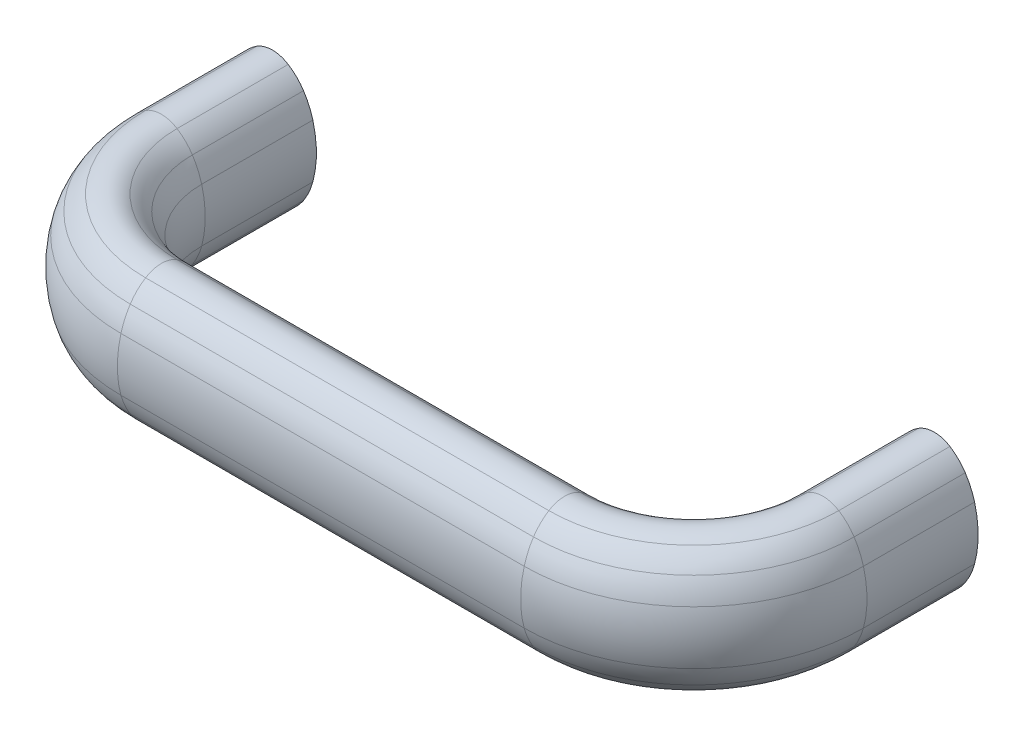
ISO-10303-21;
HEADER;
FILE_DESCRIPTION(('STEP AP214'),'2;1');
FILE_NAME('part.step','',(''),(''),'','','');
FILE_SCHEMA(('AUTOMOTIVE_DESIGN { 1 0 10303 214 1 1 1 1 }'));
ENDSEC;
DATA;
#1=APPLICATION_CONTEXT('core data for automotive mechanical design processes');
#2=APPLICATION_PROTOCOL_DEFINITION('international standard','automotive_design',2000,#1);
#3=PRODUCT_CONTEXT('',#1,'mechanical');
#4=PRODUCT('Part','Part','',(#3));
#5=PRODUCT_RELATED_PRODUCT_CATEGORY('part','',(#4));
#6=PRODUCT_DEFINITION_FORMATION('','',#4);
#7=PRODUCT_DEFINITION_CONTEXT('part definition',#1,'design');
#8=PRODUCT_DEFINITION('design','',#6,#7);
#9=PRODUCT_DEFINITION_SHAPE('','',#8);
#10=(LENGTH_UNIT() NAMED_UNIT(*) SI_UNIT(.MILLI.,.METRE.));
#11=(NAMED_UNIT(*) PLANE_ANGLE_UNIT() SI_UNIT($,.RADIAN.));
#12=(NAMED_UNIT(*) SI_UNIT($,.STERADIAN.) SOLID_ANGLE_UNIT());
#13=UNCERTAINTY_MEASURE_WITH_UNIT(LENGTH_MEASURE(1.E-05),#10,'distance_accuracy_value','');
#14=(GEOMETRIC_REPRESENTATION_CONTEXT(3) GLOBAL_UNCERTAINTY_ASSIGNED_CONTEXT((#13)) GLOBAL_UNIT_ASSIGNED_CONTEXT((#10,
#11,#12)) REPRESENTATION_CONTEXT('',''));
#15=CARTESIAN_POINT('',(0.,0.,0.));
#16=DIRECTION('',(0.,0.,1.));
#17=DIRECTION('',(1.,0.,0.));
#18=AXIS2_PLACEMENT_3D('',#15,#16,#17);
#19=CARTESIAN_POINT('',(129.10831860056,-5.5628443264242,0.));
#20=DIRECTION('',(0.,0.,-1.));
#21=DIRECTION('',(0.,-1.,0.));
#22=AXIS2_PLACEMENT_3D('',#19,#20,#21);
#23=PLANE('',#22);
#24=CARTESIAN_POINT('',(127.999387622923,-7.31331876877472,0.));
#25=DIRECTION('',(0.,0.,-1.));
#26=DIRECTION('',(0.,-1.,0.));
#27=AXIS2_PLACEMENT_3D('',#24,#25,#26);
#28=CIRCLE('',#27,5.68668538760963);
#29=CARTESIAN_POINT('',(131.042642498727,-12.1171703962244,0.));
#30=VERTEX_POINT('',#29);
#31=CARTESIAN_POINT('',(124.95613274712,-12.1171703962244,0.));
#32=VERTEX_POINT('',#31);
#33=EDGE_CURVE('E540',#30,#32,#28,.T.);
#34=ORIENTED_EDGE('',*,*,#33,.T.);
#35=CARTESIAN_POINT('',(130.217249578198,-3.81236988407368,0.));
#36=DIRECTION('',(0.,0.,-1.));
#37=DIRECTION('',(0.,-1.,0.));
#38=AXIS2_PLACEMENT_3D('',#35,#36,#37);
#39=CIRCLE('',#38,9.83102547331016);
#40=CARTESIAN_POINT('',(121.988979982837,-9.19239231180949,0.));
#41=VERTEX_POINT('',#40);
#42=EDGE_CURVE('E18',#32,#41,#39,.T.);
#43=ORIENTED_EDGE('',*,*,#42,.T.);
#44=CARTESIAN_POINT('',(133.739270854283,-1.50950981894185,0.));
#45=DIRECTION('',(0.,0.,-1.));
#46=DIRECTION('',(0.,-1.,0.));
#47=AXIS2_PLACEMENT_3D('',#44,#45,#46);
#48=CIRCLE('',#47,14.0390889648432);
#49=CARTESIAN_POINT('',(120.188367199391,-5.17952740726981,0.));
#50=VERTEX_POINT('',#49);
#51=EDGE_CURVE('E38',#41,#50,#48,.T.);
#52=ORIENTED_EDGE('',*,*,#51,.T.);
#53=CARTESIAN_POINT('',(139.312858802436,-4.15638432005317E-06,0.));
#54=DIRECTION('',(0.,0.,-1.));
#55=DIRECTION('',(0.,-1.,0.));
#56=AXIS2_PLACEMENT_3D('',#53,#54,#55);
#57=CIRCLE('',#56,19.8134711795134);
#58=CARTESIAN_POINT('',(120.188367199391,5.17951909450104,0.));
#59=VERTEX_POINT('',#58);
#60=EDGE_CURVE('E623',#50,#59,#57,.T.);
#61=ORIENTED_EDGE('',*,*,#60,.T.);
#62=CARTESIAN_POINT('',(133.739270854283,1.50950150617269,0.));
#63=DIRECTION('',(0.,0.,-1.));
#64=DIRECTION('',(0.,-1.,0.));
#65=AXIS2_PLACEMENT_3D('',#62,#63,#64);
#66=CIRCLE('',#65,14.0390889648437);
#67=CARTESIAN_POINT('',(121.988979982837,9.19238399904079,0.));
#68=VERTEX_POINT('',#67);
#69=EDGE_CURVE('E620',#59,#68,#66,.T.);
#70=ORIENTED_EDGE('',*,*,#69,.T.);
#71=CARTESIAN_POINT('',(130.217249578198,3.81236157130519,0.));
#72=DIRECTION('',(0.,0.,-1.));
#73=DIRECTION('',(0.,-1.,0.));
#74=AXIS2_PLACEMENT_3D('',#71,#72,#73);
#75=CIRCLE('',#74,9.83102547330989);
#76=CARTESIAN_POINT('',(124.95613274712,12.1171620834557,0.));
#77=VERTEX_POINT('',#76);
#78=EDGE_CURVE('E617',#68,#77,#75,.T.);
#79=ORIENTED_EDGE('',*,*,#78,.T.);
#80=CARTESIAN_POINT('',(127.999387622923,7.31331045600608,0.));
#81=DIRECTION('',(0.,0.,1.));
#82=DIRECTION('',(0.,1.,0.));
#83=AXIS2_PLACEMENT_3D('',#80,#81,#82);
#84=CIRCLE('',#83,5.68668538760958);
#85=CARTESIAN_POINT('',(131.042642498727,12.1171620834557,0.));
#86=VERTEX_POINT('',#85);
#87=EDGE_CURVE('E615',#86,#77,#84,.T.);
#88=ORIENTED_EDGE('',*,*,#87,.F.);
#89=CARTESIAN_POINT('',(125.781525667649,3.81236157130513,0.));
#90=DIRECTION('',(0.,0.,1.));
#91=DIRECTION('',(0.,1.,0.));
#92=AXIS2_PLACEMENT_3D('',#89,#90,#91);
#93=CIRCLE('',#92,9.83102547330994);
#94=CARTESIAN_POINT('',(134.009795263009,9.19238399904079,0.));
#95=VERTEX_POINT('',#94);
#96=EDGE_CURVE('E613',#95,#86,#93,.T.);
#97=ORIENTED_EDGE('',*,*,#96,.F.);
#98=CARTESIAN_POINT('',(122.259504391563,1.50950150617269,0.));
#99=DIRECTION('',(0.,0.,1.));
#100=DIRECTION('',(0.,1.,0.));
#101=AXIS2_PLACEMENT_3D('',#98,#99,#100);
#102=CIRCLE('',#101,14.0390889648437);
#103=CARTESIAN_POINT('',(135.810408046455,5.17951909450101,0.));
#104=VERTEX_POINT('',#103);
#105=EDGE_CURVE('E611',#104,#95,#102,.T.);
#106=ORIENTED_EDGE('',*,*,#105,.F.);
#107=CARTESIAN_POINT('',(116.68591644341,-4.1563845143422E-06,0.));
#108=DIRECTION('',(0.,0.,1.));
#109=DIRECTION('',(0.,1.,0.));
#110=AXIS2_PLACEMENT_3D('',#107,#108,#109);
#111=CIRCLE('',#110,19.8134711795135);
#112=CARTESIAN_POINT('',(135.810408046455,-5.17952740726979,0.));
#113=VERTEX_POINT('',#112);
#114=EDGE_CURVE('E609',#113,#104,#111,.T.);
#115=ORIENTED_EDGE('',*,*,#114,.F.);
#116=CARTESIAN_POINT('',(122.259504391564,-1.50950981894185,0.));
#117=DIRECTION('',(0.,0.,1.));
#118=DIRECTION('',(0.,1.,0.));
#119=AXIS2_PLACEMENT_3D('',#116,#117,#118);
#120=CIRCLE('',#119,14.0390889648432);
#121=CARTESIAN_POINT('',(134.009795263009,-9.19239231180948,0.));
#122=VERTEX_POINT('',#121);
#123=EDGE_CURVE('E607',#122,#113,#120,.T.);
#124=ORIENTED_EDGE('',*,*,#123,.F.);
#125=CARTESIAN_POINT('',(125.781525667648,-3.81236988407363,0.));
#126=DIRECTION('',(0.,0.,1.));
#127=DIRECTION('',(0.,1.,0.));
#128=AXIS2_PLACEMENT_3D('',#125,#126,#127);
#129=CIRCLE('',#128,9.83102547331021);
#130=EDGE_CURVE('E605',#30,#122,#129,.T.);
#131=ORIENTED_EDGE('',*,*,#130,.F.);
#132=EDGE_LOOP('',(#34,#43,#52,#61,#70,#79,#88,#97,#106,#115,#124,#131));
#133=FACE_BOUND('',#132,.T.);
#134=CARTESIAN_POINT('',(128.,0.,0.));
#135=DIRECTION('',(0.,0.,1.));
#136=DIRECTION('',(0.,1.,0.));
#137=AXIS2_PLACEMENT_3D('',#134,#135,#136);
#138=CIRCLE('',#137,4.52350000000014);
#139=CARTESIAN_POINT('',(128.,4.52350000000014,0.));
#140=VERTEX_POINT('',#139);
#141=EDGE_CURVE('E1387',#140,#140,#138,.T.);
#142=ORIENTED_EDGE('',*,*,#141,.T.);
#143=EDGE_LOOP('',(#142));
#144=FACE_BOUND('',#143,.T.);
#145=ADVANCED_FACE('F14',(#133,#144),#23,.T.);
#146=CARTESIAN_POINT('',(-1.10831860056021,-5.5628443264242,0.));
#147=DIRECTION('',(0.,0.,1.));
#148=DIRECTION('',(0.,-1.,0.));
#149=AXIS2_PLACEMENT_3D('',#146,#147,#148);
#150=PLANE('',#149);
#151=CARTESIAN_POINT('',(0.000612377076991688,-7.31331876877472,0.));
#152=DIRECTION('',(0.,0.,1.));
#153=DIRECTION('',(0.,-1.,0.));
#154=AXIS2_PLACEMENT_3D('',#151,#152,#153);
#155=CIRCLE('',#154,5.68668538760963);
#156=CARTESIAN_POINT('',(-3.04264249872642,-12.1171703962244,0.));
#157=VERTEX_POINT('',#156);
#158=CARTESIAN_POINT('',(3.04386725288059,-12.1171703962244,0.));
#159=VERTEX_POINT('',#158);
#160=EDGE_CURVE('E264',#157,#159,#155,.T.);
#161=ORIENTED_EDGE('',*,*,#160,.F.);
#162=CARTESIAN_POINT('',(2.21847433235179,-3.81236988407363,0.));
#163=DIRECTION('',(0.,0.,-1.));
#164=DIRECTION('',(0.,1.,0.));
#165=AXIS2_PLACEMENT_3D('',#162,#163,#164);
#166=CIRCLE('',#165,9.83102547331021);
#167=CARTESIAN_POINT('',(-6.00979526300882,-9.19239231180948,0.));
#168=VERTEX_POINT('',#167);
#169=EDGE_CURVE('E305',#157,#168,#166,.T.);
#170=ORIENTED_EDGE('',*,*,#169,.T.);
#171=CARTESIAN_POINT('',(5.74049560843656,-1.50950981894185,0.));
#172=DIRECTION('',(0.,0.,-1.));
#173=DIRECTION('',(0.,1.,0.));
#174=AXIS2_PLACEMENT_3D('',#171,#172,#173);
#175=CIRCLE('',#174,14.0390889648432);
#176=CARTESIAN_POINT('',(-7.81040804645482,-5.17952740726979,0.));
#177=VERTEX_POINT('',#176);
#178=EDGE_CURVE('E302',#168,#177,#175,.T.);
#179=ORIENTED_EDGE('',*,*,#178,.T.);
#180=CARTESIAN_POINT('',(11.3140835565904,-4.1563845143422E-06,0.));
#181=DIRECTION('',(0.,0.,-1.));
#182=DIRECTION('',(0.,1.,0.));
#183=AXIS2_PLACEMENT_3D('',#180,#181,#182);
#184=CIRCLE('',#183,19.8134711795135);
#185=CARTESIAN_POINT('',(-7.81040804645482,5.17951909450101,0.));
#186=VERTEX_POINT('',#185);
#187=EDGE_CURVE('E299',#177,#186,#184,.T.);
#188=ORIENTED_EDGE('',*,*,#187,.T.);
#189=CARTESIAN_POINT('',(5.74049560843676,1.50950150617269,0.));
#190=DIRECTION('',(0.,0.,-1.));
#191=DIRECTION('',(0.,1.,0.));
#192=AXIS2_PLACEMENT_3D('',#189,#190,#191);
#193=CIRCLE('',#192,14.0390889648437);
#194=CARTESIAN_POINT('',(-6.00979526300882,9.19238399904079,0.));
#195=VERTEX_POINT('',#194);
#196=EDGE_CURVE('E296',#186,#195,#193,.T.);
#197=ORIENTED_EDGE('',*,*,#196,.T.);
#198=CARTESIAN_POINT('',(2.21847433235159,3.81236157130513,0.));
#199=DIRECTION('',(0.,0.,-1.));
#200=DIRECTION('',(0.,1.,0.));
#201=AXIS2_PLACEMENT_3D('',#198,#199,#200);
#202=CIRCLE('',#201,9.83102547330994);
#203=CARTESIAN_POINT('',(-3.04264249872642,12.1171620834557,0.));
#204=VERTEX_POINT('',#203);
#205=EDGE_CURVE('E293',#195,#204,#202,.T.);
#206=ORIENTED_EDGE('',*,*,#205,.T.);
#207=CARTESIAN_POINT('',(0.000612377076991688,7.31331045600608,0.));
#208=DIRECTION('',(0.,0.,1.));
#209=DIRECTION('',(0.,-1.,0.));
#210=AXIS2_PLACEMENT_3D('',#207,#208,#209);
#211=CIRCLE('',#210,5.68668538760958);
#212=CARTESIAN_POINT('',(3.04386725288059,12.1171620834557,0.));
#213=VERTEX_POINT('',#212);
#214=EDGE_CURVE('E291',#213,#204,#211,.T.);
#215=ORIENTED_EDGE('',*,*,#214,.F.);
#216=CARTESIAN_POINT('',(-2.21724957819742,3.81236157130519,0.));
#217=DIRECTION('',(0.,0.,1.));
#218=DIRECTION('',(0.,-1.,0.));
#219=AXIS2_PLACEMENT_3D('',#216,#217,#218);
#220=CIRCLE('',#219,9.83102547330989);
#221=CARTESIAN_POINT('',(6.01102001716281,9.19238399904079,0.));
#222=VERTEX_POINT('',#221);
#223=EDGE_CURVE('E288',#222,#213,#220,.T.);
#224=ORIENTED_EDGE('',*,*,#223,.F.);
#225=CARTESIAN_POINT('',(-5.73927085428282,1.50950150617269,0.));
#226=DIRECTION('',(0.,0.,1.));
#227=DIRECTION('',(0.,-1.,0.));
#228=AXIS2_PLACEMENT_3D('',#225,#226,#227);
#229=CIRCLE('',#228,14.0390889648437);
#230=CARTESIAN_POINT('',(7.81163280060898,5.17951909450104,0.));
#231=VERTEX_POINT('',#230);
#232=EDGE_CURVE('E285',#231,#222,#229,.T.);
#233=ORIENTED_EDGE('',*,*,#232,.F.);
#234=CARTESIAN_POINT('',(-11.3128588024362,-4.15638432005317E-06,0.));
#235=DIRECTION('',(0.,0.,1.));
#236=DIRECTION('',(0.,-1.,0.));
#237=AXIS2_PLACEMENT_3D('',#234,#235,#236);
#238=CIRCLE('',#237,19.8134711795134);
#239=CARTESIAN_POINT('',(7.81163280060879,-5.17952740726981,0.));
#240=VERTEX_POINT('',#239);
#241=EDGE_CURVE('E279',#240,#231,#238,.T.);
#242=ORIENTED_EDGE('',*,*,#241,.F.);
#243=CARTESIAN_POINT('',(-5.73927085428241,-1.50950981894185,0.));
#244=DIRECTION('',(0.,0.,1.));
#245=DIRECTION('',(0.,-1.,0.));
#246=AXIS2_PLACEMENT_3D('',#243,#244,#245);
#247=CIRCLE('',#246,14.0390889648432);
#248=CARTESIAN_POINT('',(6.01102001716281,-9.19239231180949,0.));
#249=VERTEX_POINT('',#248);
#250=EDGE_CURVE('E277',#249,#240,#247,.T.);
#251=ORIENTED_EDGE('',*,*,#250,.F.);
#252=CARTESIAN_POINT('',(-2.21724957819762,-3.81236988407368,0.));
#253=DIRECTION('',(0.,0.,1.));
#254=DIRECTION('',(0.,-1.,0.));
#255=AXIS2_PLACEMENT_3D('',#252,#253,#254);
#256=CIRCLE('',#255,9.83102547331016);
#257=EDGE_CURVE('E255',#159,#249,#256,.T.);
#258=ORIENTED_EDGE('',*,*,#257,.F.);
#259=EDGE_LOOP('',(#161,#170,#179,#188,#197,#206,#215,#224,#233,#242,#251,#258));
#260=FACE_BOUND('',#259,.T.);
#261=CARTESIAN_POINT('',(0.,0.,0.));
#262=DIRECTION('',(0.,0.,-1.));
#263=DIRECTION('',(0.,1.,0.));
#264=AXIS2_PLACEMENT_3D('',#261,#262,#263);
#265=CIRCLE('',#264,4.52350000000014);
#266=CARTESIAN_POINT('',(0.,4.52350000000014,0.));
#267=VERTEX_POINT('',#266);
#268=EDGE_CURVE('E271',#267,#267,#265,.T.);
#269=ORIENTED_EDGE('',*,*,#268,.F.);
#270=EDGE_LOOP('',(#269));
#271=FACE_BOUND('',#270,.T.);
#272=ADVANCED_FACE('F273',(#260,#271),#150,.F.);
#273=CARTESIAN_POINT('',(130.217249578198,-3.81236988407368,21.5));
#274=DIRECTION('',(0.,0.,-1.));
#275=DIRECTION('',(0.,1.,0.));
#276=AXIS2_PLACEMENT_3D('',#273,#274,#275);
#277=CYLINDRICAL_SURFACE('',#276,9.83102547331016);
#278=CARTESIAN_POINT('',(130.217249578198,-3.81236988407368,21.5));
#279=DIRECTION('',(0.,0.,-1.));
#280=DIRECTION('',(0.,-1.,0.));
#281=AXIS2_PLACEMENT_3D('',#278,#279,#280);
#282=CIRCLE('',#281,9.83102547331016);
#283=CARTESIAN_POINT('',(124.95613274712,-12.1171703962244,21.5));
#284=VERTEX_POINT('',#283);
#285=CARTESIAN_POINT('',(121.988979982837,-9.19239231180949,21.5));
#286=VERTEX_POINT('',#285);
#287=EDGE_CURVE('E507',#284,#286,#282,.T.);
#288=ORIENTED_EDGE('',*,*,#287,.T.);
#289=DIRECTION('',(0.,0.,-1.));
#290=VECTOR('',#289,1.);
#291=CARTESIAN_POINT('',(121.988979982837,-9.19239231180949,21.5));
#292=LINE('',#291,#290);
#293=EDGE_CURVE('E23',#286,#41,#292,.T.);
#294=ORIENTED_EDGE('',*,*,#293,.T.);
#295=ORIENTED_EDGE('',*,*,#42,.F.);
#296=DIRECTION('',(0.,0.,-1.));
#297=VECTOR('',#296,1.);
#298=CARTESIAN_POINT('',(124.95613274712,-12.1171703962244,21.5));
#299=LINE('',#298,#297);
#300=EDGE_CURVE('E9',#284,#32,#299,.T.);
#301=ORIENTED_EDGE('',*,*,#300,.F.);
#302=EDGE_LOOP('',(#288,#294,#295,#301));
#303=FACE_BOUND('',#302,.T.);
#304=ADVANCED_FACE('F16',(#303),#277,.T.);
#305=CARTESIAN_POINT('',(133.739270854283,-1.50950981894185,21.5));
#306=DIRECTION('',(0.,0.,-1.));
#307=DIRECTION('',(0.,1.,0.));
#308=AXIS2_PLACEMENT_3D('',#305,#306,#307);
#309=CYLINDRICAL_SURFACE('',#308,14.0390889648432);
#310=CARTESIAN_POINT('',(133.739270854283,-1.50950981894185,21.5));
#311=DIRECTION('',(0.,0.,-1.));
#312=DIRECTION('',(0.,-1.,0.));
#313=AXIS2_PLACEMENT_3D('',#310,#311,#312);
#314=CIRCLE('',#313,14.0390889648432);
#315=CARTESIAN_POINT('',(120.188367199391,-5.17952740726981,21.5));
#316=VERTEX_POINT('',#315);
#317=EDGE_CURVE('E569',#286,#316,#314,.T.);
#318=ORIENTED_EDGE('',*,*,#317,.T.);
#319=DIRECTION('',(0.,0.,-1.));
#320=VECTOR('',#319,1.);
#321=CARTESIAN_POINT('',(120.188367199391,-5.17952740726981,21.5));
#322=LINE('',#321,#320);
#323=EDGE_CURVE('E601',#316,#50,#322,.T.);
#324=ORIENTED_EDGE('',*,*,#323,.T.);
#325=ORIENTED_EDGE('',*,*,#51,.F.);
#326=ORIENTED_EDGE('',*,*,#293,.F.);
#327=EDGE_LOOP('',(#318,#324,#325,#326));
#328=FACE_BOUND('',#327,.T.);
#329=ADVANCED_FACE('F630',(#328),#309,.T.);
#330=CARTESIAN_POINT('',(139.312858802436,-4.15638432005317E-06,21.5));
#331=DIRECTION('',(0.,0.,-1.));
#332=DIRECTION('',(0.,1.,0.));
#333=AXIS2_PLACEMENT_3D('',#330,#331,#332);
#334=CYLINDRICAL_SURFACE('',#333,19.8134711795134);
#335=CARTESIAN_POINT('',(139.312858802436,-4.15638432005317E-06,21.5));
#336=DIRECTION('',(0.,0.,-1.));
#337=DIRECTION('',(0.,-1.,0.));
#338=AXIS2_PLACEMENT_3D('',#335,#336,#337);
#339=CIRCLE('',#338,19.8134711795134);
#340=CARTESIAN_POINT('',(120.188367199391,5.17951909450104,21.5));
#341=VERTEX_POINT('',#340);
#342=EDGE_CURVE('E566',#316,#341,#339,.T.);
#343=ORIENTED_EDGE('',*,*,#342,.T.);
#344=DIRECTION('',(0.,0.,-1.));
#345=VECTOR('',#344,1.);
#346=CARTESIAN_POINT('',(120.188367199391,5.17951909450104,21.5));
#347=LINE('',#346,#345);
#348=EDGE_CURVE('E598',#341,#59,#347,.T.);
#349=ORIENTED_EDGE('',*,*,#348,.T.);
#350=ORIENTED_EDGE('',*,*,#60,.F.);
#351=ORIENTED_EDGE('',*,*,#323,.F.);
#352=EDGE_LOOP('',(#343,#349,#350,#351));
#353=FACE_BOUND('',#352,.T.);
#354=ADVANCED_FACE('F685',(#353),#334,.T.);
#355=CARTESIAN_POINT('',(133.739270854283,1.50950150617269,21.5));
#356=DIRECTION('',(0.,0.,-1.));
#357=DIRECTION('',(0.,1.,0.));
#358=AXIS2_PLACEMENT_3D('',#355,#356,#357);
#359=CYLINDRICAL_SURFACE('',#358,14.0390889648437);
#360=CARTESIAN_POINT('',(133.739270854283,1.50950150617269,21.5));
#361=DIRECTION('',(0.,0.,-1.));
#362=DIRECTION('',(0.,-1.,0.));
#363=AXIS2_PLACEMENT_3D('',#360,#361,#362);
#364=CIRCLE('',#363,14.0390889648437);
#365=CARTESIAN_POINT('',(121.988979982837,9.19238399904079,21.5));
#366=VERTEX_POINT('',#365);
#367=EDGE_CURVE('E563',#341,#366,#364,.T.);
#368=ORIENTED_EDGE('',*,*,#367,.T.);
#369=DIRECTION('',(0.,0.,-1.));
#370=VECTOR('',#369,1.);
#371=CARTESIAN_POINT('',(121.988979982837,9.19238399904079,21.5));
#372=LINE('',#371,#370);
#373=EDGE_CURVE('E595',#366,#68,#372,.T.);
#374=ORIENTED_EDGE('',*,*,#373,.T.);
#375=ORIENTED_EDGE('',*,*,#69,.F.);
#376=ORIENTED_EDGE('',*,*,#348,.F.);
#377=EDGE_LOOP('',(#368,#374,#375,#376));
#378=FACE_BOUND('',#377,.T.);
#379=ADVANCED_FACE('F684',(#378),#359,.T.);
#380=CARTESIAN_POINT('',(130.217249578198,3.81236157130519,21.5));
#381=DIRECTION('',(0.,0.,-1.));
#382=DIRECTION('',(0.,1.,0.));
#383=AXIS2_PLACEMENT_3D('',#380,#381,#382);
#384=CYLINDRICAL_SURFACE('',#383,9.83102547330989);
#385=CARTESIAN_POINT('',(130.217249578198,3.81236157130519,21.5));
#386=DIRECTION('',(0.,0.,-1.));
#387=DIRECTION('',(0.,-1.,0.));
#388=AXIS2_PLACEMENT_3D('',#385,#386,#387);
#389=CIRCLE('',#388,9.83102547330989);
#390=CARTESIAN_POINT('',(124.95613274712,12.1171620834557,21.5));
#391=VERTEX_POINT('',#390);
#392=EDGE_CURVE('E560',#366,#391,#389,.T.);
#393=ORIENTED_EDGE('',*,*,#392,.T.);
#394=DIRECTION('',(0.,0.,-1.));
#395=VECTOR('',#394,1.);
#396=CARTESIAN_POINT('',(124.95613274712,12.1171620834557,21.5));
#397=LINE('',#396,#395);
#398=EDGE_CURVE('E592',#391,#77,#397,.T.);
#399=ORIENTED_EDGE('',*,*,#398,.T.);
#400=ORIENTED_EDGE('',*,*,#78,.F.);
#401=ORIENTED_EDGE('',*,*,#373,.F.);
#402=EDGE_LOOP('',(#393,#399,#400,#401));
#403=FACE_BOUND('',#402,.T.);
#404=ADVANCED_FACE('F690',(#403),#384,.T.);
#405=CARTESIAN_POINT('',(127.999387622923,7.31331045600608,21.5));
#406=DIRECTION('',(0.,0.,-1.));
#407=DIRECTION('',(0.,1.,0.));
#408=AXIS2_PLACEMENT_3D('',#405,#406,#407);
#409=CYLINDRICAL_SURFACE('',#408,5.68668538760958);
#410=CARTESIAN_POINT('',(127.999387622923,7.31331045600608,21.5));
#411=DIRECTION('',(0.,0.,1.));
#412=DIRECTION('',(0.,1.,0.));
#413=AXIS2_PLACEMENT_3D('',#410,#411,#412);
#414=CIRCLE('',#413,5.68668538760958);
#415=CARTESIAN_POINT('',(131.042642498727,12.1171620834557,21.5));
#416=VERTEX_POINT('',#415);
#417=EDGE_CURVE('E558',#416,#391,#414,.T.);
#418=ORIENTED_EDGE('',*,*,#417,.F.);
#419=DIRECTION('',(0.,0.,-1.));
#420=VECTOR('',#419,1.);
#421=CARTESIAN_POINT('',(131.042642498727,12.1171620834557,21.5));
#422=LINE('',#421,#420);
#423=EDGE_CURVE('E589',#416,#86,#422,.T.);
#424=ORIENTED_EDGE('',*,*,#423,.T.);
#425=ORIENTED_EDGE('',*,*,#87,.T.);
#426=ORIENTED_EDGE('',*,*,#398,.F.);
#427=EDGE_LOOP('',(#418,#424,#425,#426));
#428=FACE_BOUND('',#427,.T.);
#429=ADVANCED_FACE('F693',(#428),#409,.T.);
#430=CARTESIAN_POINT('',(125.781525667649,3.81236157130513,21.5));
#431=DIRECTION('',(0.,0.,-1.));
#432=DIRECTION('',(0.,1.,0.));
#433=AXIS2_PLACEMENT_3D('',#430,#431,#432);
#434=CYLINDRICAL_SURFACE('',#433,9.83102547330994);
#435=CARTESIAN_POINT('',(125.781525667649,3.81236157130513,21.5));
#436=DIRECTION('',(0.,0.,1.));
#437=DIRECTION('',(0.,1.,0.));
#438=AXIS2_PLACEMENT_3D('',#435,#436,#437);
#439=CIRCLE('',#438,9.83102547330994);
#440=CARTESIAN_POINT('',(134.009795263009,9.19238399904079,21.5));
#441=VERTEX_POINT('',#440);
#442=EDGE_CURVE('E555',#441,#416,#439,.T.);
#443=ORIENTED_EDGE('',*,*,#442,.F.);
#444=DIRECTION('',(0.,0.,-1.));
#445=VECTOR('',#444,1.);
#446=CARTESIAN_POINT('',(134.009795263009,9.19238399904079,21.5));
#447=LINE('',#446,#445);
#448=EDGE_CURVE('E586',#441,#95,#447,.T.);
#449=ORIENTED_EDGE('',*,*,#448,.T.);
#450=ORIENTED_EDGE('',*,*,#96,.T.);
#451=ORIENTED_EDGE('',*,*,#423,.F.);
#452=EDGE_LOOP('',(#443,#449,#450,#451));
#453=FACE_BOUND('',#452,.T.);
#454=ADVANCED_FACE('F696',(#453),#434,.T.);
#455=CARTESIAN_POINT('',(122.259504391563,1.50950150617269,21.5));
#456=DIRECTION('',(0.,0.,-1.));
#457=DIRECTION('',(0.,1.,0.));
#458=AXIS2_PLACEMENT_3D('',#455,#456,#457);
#459=CYLINDRICAL_SURFACE('',#458,14.0390889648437);
#460=CARTESIAN_POINT('',(122.259504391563,1.50950150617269,21.5));
#461=DIRECTION('',(0.,0.,1.));
#462=DIRECTION('',(0.,1.,0.));
#463=AXIS2_PLACEMENT_3D('',#460,#461,#462);
#464=CIRCLE('',#463,14.0390889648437);
#465=CARTESIAN_POINT('',(135.810408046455,5.17951909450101,21.5));
#466=VERTEX_POINT('',#465);
#467=EDGE_CURVE('E552',#466,#441,#464,.T.);
#468=ORIENTED_EDGE('',*,*,#467,.F.);
#469=DIRECTION('',(0.,0.,-1.));
#470=VECTOR('',#469,1.);
#471=CARTESIAN_POINT('',(135.810408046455,5.17951909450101,21.5));
#472=LINE('',#471,#470);
#473=EDGE_CURVE('E583',#466,#104,#472,.T.);
#474=ORIENTED_EDGE('',*,*,#473,.T.);
#475=ORIENTED_EDGE('',*,*,#105,.T.);
#476=ORIENTED_EDGE('',*,*,#448,.F.);
#477=EDGE_LOOP('',(#468,#474,#475,#476));
#478=FACE_BOUND('',#477,.T.);
#479=ADVANCED_FACE('F702',(#478),#459,.T.);
#480=CARTESIAN_POINT('',(116.68591644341,-4.1563845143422E-06,21.5));
#481=DIRECTION('',(0.,0.,-1.));
#482=DIRECTION('',(0.,1.,0.));
#483=AXIS2_PLACEMENT_3D('',#480,#481,#482);
#484=CYLINDRICAL_SURFACE('',#483,19.8134711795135);
#485=CARTESIAN_POINT('',(116.68591644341,-4.1563845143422E-06,21.5));
#486=DIRECTION('',(0.,0.,1.));
#487=DIRECTION('',(0.,1.,0.));
#488=AXIS2_PLACEMENT_3D('',#485,#486,#487);
#489=CIRCLE('',#488,19.8134711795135);
#490=CARTESIAN_POINT('',(135.810408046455,-5.17952740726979,21.5));
#491=VERTEX_POINT('',#490);
#492=EDGE_CURVE('E549',#491,#466,#489,.T.);
#493=ORIENTED_EDGE('',*,*,#492,.F.);
#494=DIRECTION('',(0.,0.,-1.));
#495=VECTOR('',#494,1.);
#496=CARTESIAN_POINT('',(135.810408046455,-5.17952740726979,21.5));
#497=LINE('',#496,#495);
#498=EDGE_CURVE('E580',#491,#113,#497,.T.);
#499=ORIENTED_EDGE('',*,*,#498,.T.);
#500=ORIENTED_EDGE('',*,*,#114,.T.);
#501=ORIENTED_EDGE('',*,*,#473,.F.);
#502=EDGE_LOOP('',(#493,#499,#500,#501));
#503=FACE_BOUND('',#502,.T.);
#504=ADVANCED_FACE('F705',(#503),#484,.T.);
#505=CARTESIAN_POINT('',(122.259504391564,-1.50950981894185,21.5));
#506=DIRECTION('',(0.,0.,-1.));
#507=DIRECTION('',(0.,1.,0.));
#508=AXIS2_PLACEMENT_3D('',#505,#506,#507);
#509=CYLINDRICAL_SURFACE('',#508,14.0390889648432);
#510=CARTESIAN_POINT('',(122.259504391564,-1.50950981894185,21.5));
#511=DIRECTION('',(0.,0.,1.));
#512=DIRECTION('',(0.,1.,0.));
#513=AXIS2_PLACEMENT_3D('',#510,#511,#512);
#514=CIRCLE('',#513,14.0390889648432);
#515=CARTESIAN_POINT('',(134.009795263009,-9.19239231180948,21.5));
#516=VERTEX_POINT('',#515);
#517=EDGE_CURVE('E546',#516,#491,#514,.T.);
#518=ORIENTED_EDGE('',*,*,#517,.F.);
#519=DIRECTION('',(0.,0.,-1.));
#520=VECTOR('',#519,1.);
#521=CARTESIAN_POINT('',(134.009795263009,-9.19239231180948,21.5));
#522=LINE('',#521,#520);
#523=EDGE_CURVE('E577',#516,#122,#522,.T.);
#524=ORIENTED_EDGE('',*,*,#523,.T.);
#525=ORIENTED_EDGE('',*,*,#123,.T.);
#526=ORIENTED_EDGE('',*,*,#498,.F.);
#527=EDGE_LOOP('',(#518,#524,#525,#526));
#528=FACE_BOUND('',#527,.T.);
#529=ADVANCED_FACE('F708',(#528),#509,.T.);
#530=CARTESIAN_POINT('',(125.781525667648,-3.81236988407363,21.5));
#531=DIRECTION('',(0.,0.,-1.));
#532=DIRECTION('',(0.,1.,0.));
#533=AXIS2_PLACEMENT_3D('',#530,#531,#532);
#534=CYLINDRICAL_SURFACE('',#533,9.83102547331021);
#535=CARTESIAN_POINT('',(125.781525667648,-3.81236988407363,21.5));
#536=DIRECTION('',(0.,0.,1.));
#537=DIRECTION('',(0.,1.,0.));
#538=AXIS2_PLACEMENT_3D('',#535,#536,#537);
#539=CIRCLE('',#538,9.83102547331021);
#540=CARTESIAN_POINT('',(131.042642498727,-12.1171703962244,21.5));
#541=VERTEX_POINT('',#540);
#542=EDGE_CURVE('E543',#541,#516,#539,.T.);
#543=ORIENTED_EDGE('',*,*,#542,.F.);
#544=DIRECTION('',(0.,0.,-1.));
#545=VECTOR('',#544,1.);
#546=CARTESIAN_POINT('',(131.042642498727,-12.1171703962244,21.5));
#547=LINE('',#546,#545);
#548=EDGE_CURVE('E574',#541,#30,#547,.T.);
#549=ORIENTED_EDGE('',*,*,#548,.T.);
#550=ORIENTED_EDGE('',*,*,#130,.T.);
#551=ORIENTED_EDGE('',*,*,#523,.F.);
#552=EDGE_LOOP('',(#543,#549,#550,#551));
#553=FACE_BOUND('',#552,.T.);
#554=ADVANCED_FACE('F712',(#553),#534,.T.);
#555=CARTESIAN_POINT('',(127.999387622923,-7.31331876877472,21.5));
#556=DIRECTION('',(0.,0.,-1.));
#557=DIRECTION('',(0.,1.,0.));
#558=AXIS2_PLACEMENT_3D('',#555,#556,#557);
#559=CYLINDRICAL_SURFACE('',#558,5.68668538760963);
#560=CARTESIAN_POINT('',(127.999387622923,-7.31331876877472,21.5));
#561=DIRECTION('',(0.,0.,-1.));
#562=DIRECTION('',(0.,-1.,0.));
#563=AXIS2_PLACEMENT_3D('',#560,#561,#562);
#564=CIRCLE('',#563,5.68668538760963);
#565=EDGE_CURVE('E469',#541,#284,#564,.T.);
#566=ORIENTED_EDGE('',*,*,#565,.T.);
#567=ORIENTED_EDGE('',*,*,#300,.T.);
#568=ORIENTED_EDGE('',*,*,#33,.F.);
#569=ORIENTED_EDGE('',*,*,#548,.F.);
#570=EDGE_LOOP('',(#566,#567,#568,#569));
#571=FACE_BOUND('',#570,.T.);
#572=ADVANCED_FACE('F714',(#571),#559,.T.);
#573=CARTESIAN_POINT('',(103.,-3.81236988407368,21.5));
#574=DIRECTION('',(0.,1.,0.));
#575=DIRECTION('',(-1.,0.,0.));
#576=AXIS2_PLACEMENT_3D('',#573,#574,#575);
#577=TOROIDAL_SURFACE('',#576,27.2172495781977,9.83102547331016);
#578=CARTESIAN_POINT('',(103.,-3.81236988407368,48.7172495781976));
#579=DIRECTION('',(1.,0.,0.));
#580=DIRECTION('',(0.,-1.,0.));
#581=AXIS2_PLACEMENT_3D('',#578,#579,#580);
#582=CIRCLE('',#581,9.83102547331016);
#583=CARTESIAN_POINT('',(103.,-12.1171703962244,43.4561327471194));
#584=VERTEX_POINT('',#583);
#585=CARTESIAN_POINT('',(103.,-9.19239231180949,40.4889799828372));
#586=VERTEX_POINT('',#585);
#587=EDGE_CURVE('E436',#584,#586,#582,.T.);
#588=ORIENTED_EDGE('',*,*,#587,.T.);
#589=CARTESIAN_POINT('',(103.,-9.19239231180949,21.5));
#590=DIRECTION('',(0.,1.,0.));
#591=DIRECTION('',(-1.,0.,0.));
#592=AXIS2_PLACEMENT_3D('',#589,#590,#591);
#593=CIRCLE('',#592,18.9889799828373);
#594=EDGE_CURVE('E534',#586,#286,#593,.T.);
#595=ORIENTED_EDGE('',*,*,#594,.T.);
#596=ORIENTED_EDGE('',*,*,#287,.F.);
#597=CARTESIAN_POINT('',(103.,-12.1171703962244,21.5));
#598=DIRECTION('',(0.,1.,0.));
#599=DIRECTION('',(-1.,0.,0.));
#600=AXIS2_PLACEMENT_3D('',#597,#598,#599);
#601=CIRCLE('',#600,21.9561327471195);
#602=EDGE_CURVE('E537',#584,#284,#601,.T.);
#603=ORIENTED_EDGE('',*,*,#602,.F.);
#604=EDGE_LOOP('',(#588,#595,#596,#603));
#605=FACE_BOUND('',#604,.T.);
#606=ADVANCED_FACE('F718',(#605),#577,.T.);
#607=CARTESIAN_POINT('',(103.,-1.50950981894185,21.5));
#608=DIRECTION('',(0.,1.,0.));
#609=DIRECTION('',(-1.,0.,0.));
#610=AXIS2_PLACEMENT_3D('',#607,#608,#609);
#611=TOROIDAL_SURFACE('',#610,30.7392708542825,14.0390889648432);
#612=CARTESIAN_POINT('',(103.,-1.50950981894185,52.2392708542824));
#613=DIRECTION('',(1.,0.,0.));
#614=DIRECTION('',(0.,-1.,0.));
#615=AXIS2_PLACEMENT_3D('',#612,#613,#614);
#616=CIRCLE('',#615,14.0390889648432);
#617=CARTESIAN_POINT('',(103.,-5.17952740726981,38.6883671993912));
#618=VERTEX_POINT('',#617);
#619=EDGE_CURVE('E498',#586,#618,#616,.T.);
#620=ORIENTED_EDGE('',*,*,#619,.T.);
#621=CARTESIAN_POINT('',(103.,-5.17952740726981,21.5));
#622=DIRECTION('',(0.,1.,0.));
#623=DIRECTION('',(-1.,0.,0.));
#624=AXIS2_PLACEMENT_3D('',#621,#622,#623);
#625=CIRCLE('',#624,17.1883671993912);
#626=EDGE_CURVE('E531',#618,#316,#625,.T.);
#627=ORIENTED_EDGE('',*,*,#626,.T.);
#628=ORIENTED_EDGE('',*,*,#317,.F.);
#629=ORIENTED_EDGE('',*,*,#594,.F.);
#630=EDGE_LOOP('',(#620,#627,#628,#629));
#631=FACE_BOUND('',#630,.T.);
#632=ADVANCED_FACE('F637',(#631),#611,.T.);
#633=CARTESIAN_POINT('',(103.,-4.15638432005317E-06,21.5));
#634=DIRECTION('',(0.,1.,0.));
#635=DIRECTION('',(-1.,0.,0.));
#636=AXIS2_PLACEMENT_3D('',#633,#634,#635);
#637=TOROIDAL_SURFACE('',#636,36.3128588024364,19.8134711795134);
#638=CARTESIAN_POINT('',(103.,-4.15638432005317E-06,57.8128588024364));
#639=DIRECTION('',(1.,0.,0.));
#640=DIRECTION('',(0.,-1.,0.));
#641=AXIS2_PLACEMENT_3D('',#638,#639,#640);
#642=CIRCLE('',#641,19.8134711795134);
#643=CARTESIAN_POINT('',(103.,5.17951909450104,38.6883671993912));
#644=VERTEX_POINT('',#643);
#645=EDGE_CURVE('E495',#618,#644,#642,.T.);
#646=ORIENTED_EDGE('',*,*,#645,.T.);
#647=CARTESIAN_POINT('',(103.,5.17951909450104,21.5));
#648=DIRECTION('',(0.,1.,0.));
#649=DIRECTION('',(-1.,0.,0.));
#650=AXIS2_PLACEMENT_3D('',#647,#648,#649);
#651=CIRCLE('',#650,17.1883671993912);
#652=EDGE_CURVE('E528',#644,#341,#651,.T.);
#653=ORIENTED_EDGE('',*,*,#652,.T.);
#654=ORIENTED_EDGE('',*,*,#342,.F.);
#655=ORIENTED_EDGE('',*,*,#626,.F.);
#656=EDGE_LOOP('',(#646,#653,#654,#655));
#657=FACE_BOUND('',#656,.T.);
#658=ADVANCED_FACE('F634',(#657),#637,.T.);
#659=CARTESIAN_POINT('',(103.,1.50950150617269,21.5));
#660=DIRECTION('',(0.,1.,0.));
#661=DIRECTION('',(-1.,0.,0.));
#662=AXIS2_PLACEMENT_3D('',#659,#660,#661);
#663=TOROIDAL_SURFACE('',#662,30.7392708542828,14.0390889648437);
#664=CARTESIAN_POINT('',(103.,1.50950150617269,52.2392708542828));
#665=DIRECTION('',(1.,0.,0.));
#666=DIRECTION('',(0.,-1.,0.));
#667=AXIS2_PLACEMENT_3D('',#664,#665,#666);
#668=CIRCLE('',#667,14.0390889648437);
#669=CARTESIAN_POINT('',(103.,9.19238399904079,40.4889799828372));
#670=VERTEX_POINT('',#669);
#671=EDGE_CURVE('E492',#644,#670,#668,.T.);
#672=ORIENTED_EDGE('',*,*,#671,.T.);
#673=CARTESIAN_POINT('',(103.,9.19238399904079,21.5));
#674=DIRECTION('',(0.,1.,0.));
#675=DIRECTION('',(-1.,0.,0.));
#676=AXIS2_PLACEMENT_3D('',#673,#674,#675);
#677=CIRCLE('',#676,18.9889799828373);
#678=EDGE_CURVE('E525',#670,#366,#677,.T.);
#679=ORIENTED_EDGE('',*,*,#678,.T.);
#680=ORIENTED_EDGE('',*,*,#367,.F.);
#681=ORIENTED_EDGE('',*,*,#652,.F.);
#682=EDGE_LOOP('',(#672,#679,#680,#681));
#683=FACE_BOUND('',#682,.T.);
#684=ADVANCED_FACE('F682',(#683),#663,.T.);
#685=CARTESIAN_POINT('',(103.,3.81236157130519,21.5));
#686=DIRECTION('',(0.,1.,0.));
#687=DIRECTION('',(-1.,0.,0.));
#688=AXIS2_PLACEMENT_3D('',#685,#686,#687);
#689=TOROIDAL_SURFACE('',#688,27.2172495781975,9.83102547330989);
#690=CARTESIAN_POINT('',(103.,3.81236157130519,48.7172495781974));
#691=DIRECTION('',(1.,0.,0.));
#692=DIRECTION('',(0.,-1.,0.));
#693=AXIS2_PLACEMENT_3D('',#690,#691,#692);
#694=CIRCLE('',#693,9.83102547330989);
#695=CARTESIAN_POINT('',(103.,12.1171620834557,43.4561327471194));
#696=VERTEX_POINT('',#695);
#697=EDGE_CURVE('E489',#670,#696,#694,.T.);
#698=ORIENTED_EDGE('',*,*,#697,.T.);
#699=CARTESIAN_POINT('',(103.,12.1171620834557,21.5));
#700=DIRECTION('',(0.,1.,0.));
#701=DIRECTION('',(-1.,0.,0.));
#702=AXIS2_PLACEMENT_3D('',#699,#700,#701);
#703=CIRCLE('',#702,21.9561327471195);
#704=EDGE_CURVE('E522',#696,#391,#703,.T.);
#705=ORIENTED_EDGE('',*,*,#704,.T.);
#706=ORIENTED_EDGE('',*,*,#392,.F.);
#707=ORIENTED_EDGE('',*,*,#678,.F.);
#708=EDGE_LOOP('',(#698,#705,#706,#707));
#709=FACE_BOUND('',#708,.T.);
#710=ADVANCED_FACE('F678',(#709),#689,.T.);
#711=CARTESIAN_POINT('',(103.,7.31331045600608,21.5));
#712=DIRECTION('',(0.,1.,0.));
#713=DIRECTION('',(-1.,0.,0.));
#714=AXIS2_PLACEMENT_3D('',#711,#712,#713);
#715=TOROIDAL_SURFACE('',#714,24.999387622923,5.68668538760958);
#716=CARTESIAN_POINT('',(103.,7.31331045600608,46.499387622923));
#717=DIRECTION('',(-1.,0.,0.));
#718=DIRECTION('',(0.,1.,0.));
#719=AXIS2_PLACEMENT_3D('',#716,#717,#718);
#720=CIRCLE('',#719,5.68668538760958);
#721=CARTESIAN_POINT('',(103.,12.1171620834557,49.5426424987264));
#722=VERTEX_POINT('',#721);
#723=EDGE_CURVE('E487',#722,#696,#720,.T.);
#724=ORIENTED_EDGE('',*,*,#723,.F.);
#725=CARTESIAN_POINT('',(103.,12.1171620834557,21.5));
#726=DIRECTION('',(0.,1.,0.));
#727=DIRECTION('',(-1.,0.,0.));
#728=AXIS2_PLACEMENT_3D('',#725,#726,#727);
#729=CIRCLE('',#728,28.0426424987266);
#730=EDGE_CURVE('E519',#722,#416,#729,.T.);
#731=ORIENTED_EDGE('',*,*,#730,.T.);
#732=ORIENTED_EDGE('',*,*,#417,.T.);
#733=ORIENTED_EDGE('',*,*,#704,.F.);
#734=EDGE_LOOP('',(#724,#731,#732,#733));
#735=FACE_BOUND('',#734,.T.);
#736=ADVANCED_FACE('F1023',(#735),#715,.T.);
#737=CARTESIAN_POINT('',(103.,3.81236157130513,21.5));
#738=DIRECTION('',(0.,1.,0.));
#739=DIRECTION('',(-1.,0.,0.));
#740=AXIS2_PLACEMENT_3D('',#737,#738,#739);
#741=TOROIDAL_SURFACE('',#740,22.7815256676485,9.83102547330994);
#742=CARTESIAN_POINT('',(103.,3.81236157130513,44.2815256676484));
#743=DIRECTION('',(-1.,0.,0.));
#744=DIRECTION('',(0.,1.,0.));
#745=AXIS2_PLACEMENT_3D('',#742,#743,#744);
#746=CIRCLE('',#745,9.83102547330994);
#747=CARTESIAN_POINT('',(103.,9.19238399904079,52.5097952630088));
#748=VERTEX_POINT('',#747);
#749=EDGE_CURVE('E484',#748,#722,#746,.T.);
#750=ORIENTED_EDGE('',*,*,#749,.F.);
#751=CARTESIAN_POINT('',(103.,9.19238399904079,21.5));
#752=DIRECTION('',(0.,1.,0.));
#753=DIRECTION('',(-1.,0.,0.));
#754=AXIS2_PLACEMENT_3D('',#751,#752,#753);
#755=CIRCLE('',#754,31.0097952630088);
#756=EDGE_CURVE('E516',#748,#441,#755,.T.);
#757=ORIENTED_EDGE('',*,*,#756,.T.);
#758=ORIENTED_EDGE('',*,*,#442,.T.);
#759=ORIENTED_EDGE('',*,*,#730,.F.);
#760=EDGE_LOOP('',(#750,#757,#758,#759));
#761=FACE_BOUND('',#760,.T.);
#762=ADVANCED_FACE('F1032',(#761),#741,.T.);
#763=CARTESIAN_POINT('',(103.,1.50950150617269,21.5));
#764=DIRECTION('',(0.,1.,0.));
#765=DIRECTION('',(-1.,0.,0.));
#766=AXIS2_PLACEMENT_3D('',#763,#764,#765);
#767=TOROIDAL_SURFACE('',#766,19.2595043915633,14.0390889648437);
#768=CARTESIAN_POINT('',(103.,1.50950150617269,40.7595043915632));
#769=DIRECTION('',(-1.,0.,0.));
#770=DIRECTION('',(0.,1.,0.));
#771=AXIS2_PLACEMENT_3D('',#768,#769,#770);
#772=CIRCLE('',#771,14.0390889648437);
#773=CARTESIAN_POINT('',(103.,5.17951909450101,54.3104080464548));
#774=VERTEX_POINT('',#773);
#775=EDGE_CURVE('E481',#774,#748,#772,.T.);
#776=ORIENTED_EDGE('',*,*,#775,.F.);
#777=CARTESIAN_POINT('',(103.,5.17951909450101,21.5));
#778=DIRECTION('',(0.,1.,0.));
#779=DIRECTION('',(-1.,0.,0.));
#780=AXIS2_PLACEMENT_3D('',#777,#778,#779);
#781=CIRCLE('',#780,32.8104080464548);
#782=EDGE_CURVE('E513',#774,#466,#781,.T.);
#783=ORIENTED_EDGE('',*,*,#782,.T.);
#784=ORIENTED_EDGE('',*,*,#467,.T.);
#785=ORIENTED_EDGE('',*,*,#756,.F.);
#786=EDGE_LOOP('',(#776,#783,#784,#785));
#787=FACE_BOUND('',#786,.T.);
#788=ADVANCED_FACE('F1042',(#787),#767,.T.);
#789=CARTESIAN_POINT('',(103.,-4.1563845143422E-06,21.5));
#790=DIRECTION('',(0.,1.,0.));
#791=DIRECTION('',(-1.,0.,0.));
#792=AXIS2_PLACEMENT_3D('',#789,#790,#791);
#793=DEGENERATE_TOROIDAL_SURFACE('',#792,13.6859164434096,19.8134711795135,.T.);
#794=CARTESIAN_POINT('',(103.,-4.1563845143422E-06,35.1859164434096));
#795=DIRECTION('',(-1.,0.,0.));
#796=DIRECTION('',(0.,1.,0.));
#797=AXIS2_PLACEMENT_3D('',#794,#795,#796);
#798=CIRCLE('',#797,19.8134711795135);
#799=CARTESIAN_POINT('',(103.,-5.17952740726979,54.3104080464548));
#800=VERTEX_POINT('',#799);
#801=EDGE_CURVE('E478',#800,#774,#798,.T.);
#802=ORIENTED_EDGE('',*,*,#801,.F.);
#803=CARTESIAN_POINT('',(103.,-5.17952740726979,21.5));
#804=DIRECTION('',(0.,1.,0.));
#805=DIRECTION('',(-1.,0.,0.));
#806=AXIS2_PLACEMENT_3D('',#803,#804,#805);
#807=CIRCLE('',#806,32.8104080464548);
#808=EDGE_CURVE('E510',#800,#491,#807,.T.);
#809=ORIENTED_EDGE('',*,*,#808,.T.);
#810=ORIENTED_EDGE('',*,*,#492,.T.);
#811=ORIENTED_EDGE('',*,*,#782,.F.);
#812=EDGE_LOOP('',(#802,#809,#810,#811));
#813=FACE_BOUND('',#812,.T.);
#814=ADVANCED_FACE('F1052',(#813),#793,.T.);
#815=CARTESIAN_POINT('',(103.,-1.50950981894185,21.5));
#816=DIRECTION('',(0.,1.,0.));
#817=DIRECTION('',(-1.,0.,0.));
#818=AXIS2_PLACEMENT_3D('',#815,#816,#817);
#819=TOROIDAL_SURFACE('',#818,19.2595043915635,14.0390889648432);
#820=CARTESIAN_POINT('',(103.,-1.50950981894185,40.7595043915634));
#821=DIRECTION('',(-1.,0.,0.));
#822=DIRECTION('',(0.,1.,0.));
#823=AXIS2_PLACEMENT_3D('',#820,#821,#822);
#824=CIRCLE('',#823,14.0390889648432);
#825=CARTESIAN_POINT('',(103.,-9.19239231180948,52.5097952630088));
#826=VERTEX_POINT('',#825);
#827=EDGE_CURVE('E475',#826,#800,#824,.T.);
#828=ORIENTED_EDGE('',*,*,#827,.F.);
#829=CARTESIAN_POINT('',(103.,-9.19239231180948,21.5));
#830=DIRECTION('',(0.,1.,0.));
#831=DIRECTION('',(-1.,0.,0.));
#832=AXIS2_PLACEMENT_3D('',#829,#830,#831);
#833=CIRCLE('',#832,31.0097952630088);
#834=EDGE_CURVE('E506',#826,#516,#833,.T.);
#835=ORIENTED_EDGE('',*,*,#834,.T.);
#836=ORIENTED_EDGE('',*,*,#517,.T.);
#837=ORIENTED_EDGE('',*,*,#808,.F.);
#838=EDGE_LOOP('',(#828,#835,#836,#837));
#839=FACE_BOUND('',#838,.T.);
#840=ADVANCED_FACE('F1062',(#839),#819,.T.);
#841=CARTESIAN_POINT('',(103.,-3.81236988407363,21.5));
#842=DIRECTION('',(0.,1.,0.));
#843=DIRECTION('',(-1.,0.,0.));
#844=AXIS2_PLACEMENT_3D('',#841,#842,#843);
#845=TOROIDAL_SURFACE('',#844,22.7815256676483,9.83102547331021);
#846=CARTESIAN_POINT('',(103.,-3.81236988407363,44.2815256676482));
#847=DIRECTION('',(-1.,0.,0.));
#848=DIRECTION('',(0.,1.,0.));
#849=AXIS2_PLACEMENT_3D('',#846,#847,#848);
#850=CIRCLE('',#849,9.83102547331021);
#851=CARTESIAN_POINT('',(103.,-12.1171703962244,49.5426424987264));
#852=VERTEX_POINT('',#851);
#853=EDGE_CURVE('E472',#852,#826,#850,.T.);
#854=ORIENTED_EDGE('',*,*,#853,.F.);
#855=CARTESIAN_POINT('',(103.,-12.1171703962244,21.5));
#856=DIRECTION('',(0.,1.,0.));
#857=DIRECTION('',(-1.,0.,0.));
#858=AXIS2_PLACEMENT_3D('',#855,#856,#857);
#859=CIRCLE('',#858,28.0426424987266);
#860=EDGE_CURVE('E503',#852,#541,#859,.T.);
#861=ORIENTED_EDGE('',*,*,#860,.T.);
#862=ORIENTED_EDGE('',*,*,#542,.T.);
#863=ORIENTED_EDGE('',*,*,#834,.F.);
#864=EDGE_LOOP('',(#854,#861,#862,#863));
#865=FACE_BOUND('',#864,.T.);
#866=ADVANCED_FACE('F1072',(#865),#845,.T.);
#867=CARTESIAN_POINT('',(103.,-7.31331876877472,21.5));
#868=DIRECTION('',(0.,1.,0.));
#869=DIRECTION('',(-1.,0.,0.));
#870=AXIS2_PLACEMENT_3D('',#867,#868,#869);
#871=TOROIDAL_SURFACE('',#870,24.999387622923,5.68668538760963);
#872=CARTESIAN_POINT('',(103.,-7.31331876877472,46.499387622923));
#873=DIRECTION('',(1.,0.,0.));
#874=DIRECTION('',(0.,-1.,0.));
#875=AXIS2_PLACEMENT_3D('',#872,#873,#874);
#876=CIRCLE('',#875,5.68668538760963);
#877=EDGE_CURVE('E398',#852,#584,#876,.T.);
#878=ORIENTED_EDGE('',*,*,#877,.T.);
#879=ORIENTED_EDGE('',*,*,#602,.T.);
#880=ORIENTED_EDGE('',*,*,#565,.F.);
#881=ORIENTED_EDGE('',*,*,#860,.F.);
#882=EDGE_LOOP('',(#878,#879,#880,#881));
#883=FACE_BOUND('',#882,.T.);
#884=ADVANCED_FACE('F719',(#883),#871,.T.);
#885=CARTESIAN_POINT('',(25.,-3.81236988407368,48.7172495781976));
#886=DIRECTION('',(1.,0.,0.));
#887=DIRECTION('',(0.,1.,0.));
#888=AXIS2_PLACEMENT_3D('',#885,#886,#887);
#889=CYLINDRICAL_SURFACE('',#888,9.83102547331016);
#890=CARTESIAN_POINT('',(25.,-3.81236988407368,48.7172495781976));
#891=DIRECTION('',(1.,0.,0.));
#892=DIRECTION('',(0.,-1.,0.));
#893=AXIS2_PLACEMENT_3D('',#890,#891,#892);
#894=CIRCLE('',#893,9.83102547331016);
#895=CARTESIAN_POINT('',(25.,-12.1171703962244,43.4561327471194));
#896=VERTEX_POINT('',#895);
#897=CARTESIAN_POINT('',(25.,-9.19239231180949,40.4889799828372));
#898=VERTEX_POINT('',#897);
#899=EDGE_CURVE('E365',#896,#898,#894,.T.);
#900=ORIENTED_EDGE('',*,*,#899,.T.);
#901=DIRECTION('',(1.,0.,0.));
#902=VECTOR('',#901,1.);
#903=CARTESIAN_POINT('',(25.,-9.19239231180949,40.4889799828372));
#904=LINE('',#903,#902);
#905=EDGE_CURVE('E463',#898,#586,#904,.T.);
#906=ORIENTED_EDGE('',*,*,#905,.T.);
#907=ORIENTED_EDGE('',*,*,#587,.F.);
#908=DIRECTION('',(1.,0.,0.));
#909=VECTOR('',#908,1.);
#910=CARTESIAN_POINT('',(25.,-12.1171703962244,43.4561327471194));
#911=LINE('',#910,#909);
#912=EDGE_CURVE('E466',#896,#584,#911,.T.);
#913=ORIENTED_EDGE('',*,*,#912,.F.);
#914=EDGE_LOOP('',(#900,#906,#907,#913));
#915=FACE_BOUND('',#914,.T.);
#916=ADVANCED_FACE('F725',(#915),#889,.T.);
#917=CARTESIAN_POINT('',(25.,-1.50950981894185,52.2392708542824));
#918=DIRECTION('',(1.,0.,0.));
#919=DIRECTION('',(0.,1.,0.));
#920=AXIS2_PLACEMENT_3D('',#917,#918,#919);
#921=CYLINDRICAL_SURFACE('',#920,14.0390889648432);
#922=CARTESIAN_POINT('',(25.,-1.50950981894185,52.2392708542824));
#923=DIRECTION('',(1.,0.,0.));
#924=DIRECTION('',(0.,-1.,0.));
#925=AXIS2_PLACEMENT_3D('',#922,#923,#924);
#926=CIRCLE('',#925,14.0390889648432);
#927=CARTESIAN_POINT('',(25.,-5.17952740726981,38.6883671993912));
#928=VERTEX_POINT('',#927);
#929=EDGE_CURVE('E427',#898,#928,#926,.T.);
#930=ORIENTED_EDGE('',*,*,#929,.T.);
#931=DIRECTION('',(1.,0.,0.));
#932=VECTOR('',#931,1.);
#933=CARTESIAN_POINT('',(25.,-5.17952740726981,38.6883671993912));
#934=LINE('',#933,#932);
#935=EDGE_CURVE('E460',#928,#618,#934,.T.);
#936=ORIENTED_EDGE('',*,*,#935,.T.);
#937=ORIENTED_EDGE('',*,*,#619,.F.);
#938=ORIENTED_EDGE('',*,*,#905,.F.);
#939=EDGE_LOOP('',(#930,#936,#937,#938));
#940=FACE_BOUND('',#939,.T.);
#941=ADVANCED_FACE('F644',(#940),#921,.T.);
#942=CARTESIAN_POINT('',(25.,-4.15638432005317E-06,57.8128588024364));
#943=DIRECTION('',(1.,0.,0.));
#944=DIRECTION('',(0.,1.,0.));
#945=AXIS2_PLACEMENT_3D('',#942,#943,#944);
#946=CYLINDRICAL_SURFACE('',#945,19.8134711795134);
#947=CARTESIAN_POINT('',(25.,-4.15638432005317E-06,57.8128588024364));
#948=DIRECTION('',(1.,0.,0.));
#949=DIRECTION('',(0.,-1.,0.));
#950=AXIS2_PLACEMENT_3D('',#947,#948,#949);
#951=CIRCLE('',#950,19.8134711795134);
#952=CARTESIAN_POINT('',(25.,5.17951909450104,38.6883671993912));
#953=VERTEX_POINT('',#952);
#954=EDGE_CURVE('E424',#928,#953,#951,.T.);
#955=ORIENTED_EDGE('',*,*,#954,.T.);
#956=DIRECTION('',(1.,0.,0.));
#957=VECTOR('',#956,1.);
#958=CARTESIAN_POINT('',(25.,5.17951909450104,38.6883671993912));
#959=LINE('',#958,#957);
#960=EDGE_CURVE('E457',#953,#644,#959,.T.);
#961=ORIENTED_EDGE('',*,*,#960,.T.);
#962=ORIENTED_EDGE('',*,*,#645,.F.);
#963=ORIENTED_EDGE('',*,*,#935,.F.);
#964=EDGE_LOOP('',(#955,#961,#962,#963));
#965=FACE_BOUND('',#964,.T.);
#966=ADVANCED_FACE('F642',(#965),#946,.T.);
#967=CARTESIAN_POINT('',(25.,1.50950150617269,52.2392708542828));
#968=DIRECTION('',(1.,0.,0.));
#969=DIRECTION('',(0.,1.,0.));
#970=AXIS2_PLACEMENT_3D('',#967,#968,#969);
#971=CYLINDRICAL_SURFACE('',#970,14.0390889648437);
#972=CARTESIAN_POINT('',(25.,1.50950150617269,52.2392708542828));
#973=DIRECTION('',(1.,0.,0.));
#974=DIRECTION('',(0.,-1.,0.));
#975=AXIS2_PLACEMENT_3D('',#972,#973,#974);
#976=CIRCLE('',#975,14.0390889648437);
#977=CARTESIAN_POINT('',(25.,9.19238399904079,40.4889799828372));
#978=VERTEX_POINT('',#977);
#979=EDGE_CURVE('E421',#953,#978,#976,.T.);
#980=ORIENTED_EDGE('',*,*,#979,.T.);
#981=DIRECTION('',(1.,0.,0.));
#982=VECTOR('',#981,1.);
#983=CARTESIAN_POINT('',(25.,9.19238399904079,40.4889799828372));
#984=LINE('',#983,#982);
#985=EDGE_CURVE('E454',#978,#670,#984,.T.);
#986=ORIENTED_EDGE('',*,*,#985,.T.);
#987=ORIENTED_EDGE('',*,*,#671,.F.);
#988=ORIENTED_EDGE('',*,*,#960,.F.);
#989=EDGE_LOOP('',(#980,#986,#987,#988));
#990=FACE_BOUND('',#989,.T.);
#991=ADVANCED_FACE('F670',(#990),#971,.T.);
#992=CARTESIAN_POINT('',(25.,3.81236157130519,48.7172495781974));
#993=DIRECTION('',(1.,0.,0.));
#994=DIRECTION('',(0.,1.,0.));
#995=AXIS2_PLACEMENT_3D('',#992,#993,#994);
#996=CYLINDRICAL_SURFACE('',#995,9.83102547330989);
#997=CARTESIAN_POINT('',(25.,3.81236157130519,48.7172495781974));
#998=DIRECTION('',(1.,0.,0.));
#999=DIRECTION('',(0.,-1.,0.));
#1000=AXIS2_PLACEMENT_3D('',#997,#998,#999);
#1001=CIRCLE('',#1000,9.83102547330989);
#1002=CARTESIAN_POINT('',(25.,12.1171620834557,43.4561327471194));
#1003=VERTEX_POINT('',#1002);
#1004=EDGE_CURVE('E418',#978,#1003,#1001,.T.);
#1005=ORIENTED_EDGE('',*,*,#1004,.T.);
#1006=DIRECTION('',(1.,0.,0.));
#1007=VECTOR('',#1006,1.);
#1008=CARTESIAN_POINT('',(25.,12.1171620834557,43.4561327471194));
#1009=LINE('',#1008,#1007);
#1010=EDGE_CURVE('E451',#1003,#696,#1009,.T.);
#1011=ORIENTED_EDGE('',*,*,#1010,.T.);
#1012=ORIENTED_EDGE('',*,*,#697,.F.);
#1013=ORIENTED_EDGE('',*,*,#985,.F.);
#1014=EDGE_LOOP('',(#1005,#1011,#1012,#1013));
#1015=FACE_BOUND('',#1014,.T.);
#1016=ADVANCED_FACE('F674',(#1015),#996,.T.);
#1017=CARTESIAN_POINT('',(25.,7.31331045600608,46.499387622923));
#1018=DIRECTION('',(1.,0.,0.));
#1019=DIRECTION('',(0.,1.,0.));
#1020=AXIS2_PLACEMENT_3D('',#1017,#1018,#1019);
#1021=CYLINDRICAL_SURFACE('',#1020,5.68668538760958);
#1022=CARTESIAN_POINT('',(25.,7.31331045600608,46.499387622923));
#1023=DIRECTION('',(-1.,0.,0.));
#1024=DIRECTION('',(0.,1.,0.));
#1025=AXIS2_PLACEMENT_3D('',#1022,#1023,#1024);
#1026=CIRCLE('',#1025,5.68668538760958);
#1027=CARTESIAN_POINT('',(25.,12.1171620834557,49.5426424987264));
#1028=VERTEX_POINT('',#1027);
#1029=EDGE_CURVE('E416',#1028,#1003,#1026,.T.);
#1030=ORIENTED_EDGE('',*,*,#1029,.F.);
#1031=DIRECTION('',(1.,0.,0.));
#1032=VECTOR('',#1031,1.);
#1033=CARTESIAN_POINT('',(25.,12.1171620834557,49.5426424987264));
#1034=LINE('',#1033,#1032);
#1035=EDGE_CURVE('E448',#1028,#722,#1034,.T.);
#1036=ORIENTED_EDGE('',*,*,#1035,.T.);
#1037=ORIENTED_EDGE('',*,*,#723,.T.);
#1038=ORIENTED_EDGE('',*,*,#1010,.F.);
#1039=EDGE_LOOP('',(#1030,#1036,#1037,#1038));
#1040=FACE_BOUND('',#1039,.T.);
#1041=ADVANCED_FACE('F1131',(#1040),#1021,.T.);
#1042=CARTESIAN_POINT('',(25.,3.81236157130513,44.2815256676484));
#1043=DIRECTION('',(1.,0.,0.));
#1044=DIRECTION('',(0.,1.,0.));
#1045=AXIS2_PLACEMENT_3D('',#1042,#1043,#1044);
#1046=CYLINDRICAL_SURFACE('',#1045,9.83102547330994);
#1047=CARTESIAN_POINT('',(25.,3.81236157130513,44.2815256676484));
#1048=DIRECTION('',(-1.,0.,0.));
#1049=DIRECTION('',(0.,1.,0.));
#1050=AXIS2_PLACEMENT_3D('',#1047,#1048,#1049);
#1051=CIRCLE('',#1050,9.83102547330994);
#1052=CARTESIAN_POINT('',(25.,9.19238399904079,52.5097952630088));
#1053=VERTEX_POINT('',#1052);
#1054=EDGE_CURVE('E413',#1053,#1028,#1051,.T.);
#1055=ORIENTED_EDGE('',*,*,#1054,.F.);
#1056=DIRECTION('',(1.,0.,0.));
#1057=VECTOR('',#1056,1.);
#1058=CARTESIAN_POINT('',(25.,9.19238399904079,52.5097952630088));
#1059=LINE('',#1058,#1057);
#1060=EDGE_CURVE('E445',#1053,#748,#1059,.T.);
#1061=ORIENTED_EDGE('',*,*,#1060,.T.);
#1062=ORIENTED_EDGE('',*,*,#749,.T.);
#1063=ORIENTED_EDGE('',*,*,#1035,.F.);
#1064=EDGE_LOOP('',(#1055,#1061,#1062,#1063));
#1065=FACE_BOUND('',#1064,.T.);
#1066=ADVANCED_FACE('F1140',(#1065),#1046,.T.);
#1067=CARTESIAN_POINT('',(25.,1.50950150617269,40.7595043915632));
#1068=DIRECTION('',(1.,0.,0.));
#1069=DIRECTION('',(0.,1.,0.));
#1070=AXIS2_PLACEMENT_3D('',#1067,#1068,#1069);
#1071=CYLINDRICAL_SURFACE('',#1070,14.0390889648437);
#1072=CARTESIAN_POINT('',(25.,1.50950150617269,40.7595043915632));
#1073=DIRECTION('',(-1.,0.,0.));
#1074=DIRECTION('',(0.,1.,0.));
#1075=AXIS2_PLACEMENT_3D('',#1072,#1073,#1074);
#1076=CIRCLE('',#1075,14.0390889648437);
#1077=CARTESIAN_POINT('',(25.,5.17951909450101,54.3104080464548));
#1078=VERTEX_POINT('',#1077);
#1079=EDGE_CURVE('E410',#1078,#1053,#1076,.T.);
#1080=ORIENTED_EDGE('',*,*,#1079,.F.);
#1081=DIRECTION('',(1.,0.,0.));
#1082=VECTOR('',#1081,1.);
#1083=CARTESIAN_POINT('',(25.,5.17951909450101,54.3104080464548));
#1084=LINE('',#1083,#1082);
#1085=EDGE_CURVE('E442',#1078,#774,#1084,.T.);
#1086=ORIENTED_EDGE('',*,*,#1085,.T.);
#1087=ORIENTED_EDGE('',*,*,#775,.T.);
#1088=ORIENTED_EDGE('',*,*,#1060,.F.);
#1089=EDGE_LOOP('',(#1080,#1086,#1087,#1088));
#1090=FACE_BOUND('',#1089,.T.);
#1091=ADVANCED_FACE('F1150',(#1090),#1071,.T.);
#1092=CARTESIAN_POINT('',(25.,-4.1563845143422E-06,35.1859164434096));
#1093=DIRECTION('',(1.,0.,0.));
#1094=DIRECTION('',(0.,1.,0.));
#1095=AXIS2_PLACEMENT_3D('',#1092,#1093,#1094);
#1096=CYLINDRICAL_SURFACE('',#1095,19.8134711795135);
#1097=CARTESIAN_POINT('',(25.,-4.1563845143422E-06,35.1859164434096));
#1098=DIRECTION('',(-1.,0.,0.));
#1099=DIRECTION('',(0.,1.,0.));
#1100=AXIS2_PLACEMENT_3D('',#1097,#1098,#1099);
#1101=CIRCLE('',#1100,19.8134711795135);
#1102=CARTESIAN_POINT('',(25.,-5.17952740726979,54.3104080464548));
#1103=VERTEX_POINT('',#1102);
#1104=EDGE_CURVE('E407',#1103,#1078,#1101,.T.);
#1105=ORIENTED_EDGE('',*,*,#1104,.F.);
#1106=DIRECTION('',(1.,0.,0.));
#1107=VECTOR('',#1106,1.);
#1108=CARTESIAN_POINT('',(25.,-5.17952740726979,54.3104080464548));
#1109=LINE('',#1108,#1107);
#1110=EDGE_CURVE('E439',#1103,#800,#1109,.T.);
#1111=ORIENTED_EDGE('',*,*,#1110,.T.);
#1112=ORIENTED_EDGE('',*,*,#801,.T.);
#1113=ORIENTED_EDGE('',*,*,#1085,.F.);
#1114=EDGE_LOOP('',(#1105,#1111,#1112,#1113));
#1115=FACE_BOUND('',#1114,.T.);
#1116=ADVANCED_FACE('F1160',(#1115),#1096,.T.);
#1117=CARTESIAN_POINT('',(25.,-1.50950981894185,40.7595043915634));
#1118=DIRECTION('',(1.,0.,0.));
#1119=DIRECTION('',(0.,1.,0.));
#1120=AXIS2_PLACEMENT_3D('',#1117,#1118,#1119);
#1121=CYLINDRICAL_SURFACE('',#1120,14.0390889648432);
#1122=CARTESIAN_POINT('',(25.,-1.50950981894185,40.7595043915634));
#1123=DIRECTION('',(-1.,0.,0.));
#1124=DIRECTION('',(0.,1.,0.));
#1125=AXIS2_PLACEMENT_3D('',#1122,#1123,#1124);
#1126=CIRCLE('',#1125,14.0390889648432);
#1127=CARTESIAN_POINT('',(25.,-9.19239231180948,52.5097952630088));
#1128=VERTEX_POINT('',#1127);
#1129=EDGE_CURVE('E404',#1128,#1103,#1126,.T.);
#1130=ORIENTED_EDGE('',*,*,#1129,.F.);
#1131=DIRECTION('',(1.,0.,0.));
#1132=VECTOR('',#1131,1.);
#1133=CARTESIAN_POINT('',(25.,-9.19239231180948,52.5097952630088));
#1134=LINE('',#1133,#1132);
#1135=EDGE_CURVE('E435',#1128,#826,#1134,.T.);
#1136=ORIENTED_EDGE('',*,*,#1135,.T.);
#1137=ORIENTED_EDGE('',*,*,#827,.T.);
#1138=ORIENTED_EDGE('',*,*,#1110,.F.);
#1139=EDGE_LOOP('',(#1130,#1136,#1137,#1138));
#1140=FACE_BOUND('',#1139,.T.);
#1141=ADVANCED_FACE('F1170',(#1140),#1121,.T.);
#1142=CARTESIAN_POINT('',(25.,-3.81236988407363,44.2815256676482));
#1143=DIRECTION('',(1.,0.,0.));
#1144=DIRECTION('',(0.,1.,0.));
#1145=AXIS2_PLACEMENT_3D('',#1142,#1143,#1144);
#1146=CYLINDRICAL_SURFACE('',#1145,9.83102547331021);
#1147=CARTESIAN_POINT('',(25.,-3.81236988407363,44.2815256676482));
#1148=DIRECTION('',(-1.,0.,0.));
#1149=DIRECTION('',(0.,1.,0.));
#1150=AXIS2_PLACEMENT_3D('',#1147,#1148,#1149);
#1151=CIRCLE('',#1150,9.83102547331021);
#1152=CARTESIAN_POINT('',(25.,-12.1171703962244,49.5426424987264));
#1153=VERTEX_POINT('',#1152);
#1154=EDGE_CURVE('E401',#1153,#1128,#1151,.T.);
#1155=ORIENTED_EDGE('',*,*,#1154,.F.);
#1156=DIRECTION('',(1.,0.,0.));
#1157=VECTOR('',#1156,1.);
#1158=CARTESIAN_POINT('',(25.,-12.1171703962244,49.5426424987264));
#1159=LINE('',#1158,#1157);
#1160=EDGE_CURVE('E432',#1153,#852,#1159,.T.);
#1161=ORIENTED_EDGE('',*,*,#1160,.T.);
#1162=ORIENTED_EDGE('',*,*,#853,.T.);
#1163=ORIENTED_EDGE('',*,*,#1135,.F.);
#1164=EDGE_LOOP('',(#1155,#1161,#1162,#1163));
#1165=FACE_BOUND('',#1164,.T.);
#1166=ADVANCED_FACE('F1180',(#1165),#1146,.T.);
#1167=CARTESIAN_POINT('',(25.,-7.31331876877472,46.499387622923));
#1168=DIRECTION('',(1.,0.,0.));
#1169=DIRECTION('',(0.,1.,0.));
#1170=AXIS2_PLACEMENT_3D('',#1167,#1168,#1169);
#1171=CYLINDRICAL_SURFACE('',#1170,5.68668538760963);
#1172=CARTESIAN_POINT('',(25.,-7.31331876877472,46.499387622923));
#1173=DIRECTION('',(1.,0.,0.));
#1174=DIRECTION('',(0.,-1.,0.));
#1175=AXIS2_PLACEMENT_3D('',#1172,#1173,#1174);
#1176=CIRCLE('',#1175,5.68668538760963);
#1177=EDGE_CURVE('E260',#1153,#896,#1176,.T.);
#1178=ORIENTED_EDGE('',*,*,#1177,.T.);
#1179=ORIENTED_EDGE('',*,*,#912,.T.);
#1180=ORIENTED_EDGE('',*,*,#877,.F.);
#1181=ORIENTED_EDGE('',*,*,#1160,.F.);
#1182=EDGE_LOOP('',(#1178,#1179,#1180,#1181));
#1183=FACE_BOUND('',#1182,.T.);
#1184=ADVANCED_FACE('F726',(#1183),#1171,.T.);
#1185=CARTESIAN_POINT('',(25.,-3.81236988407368,21.5));
#1186=DIRECTION('',(0.,1.,0.));
#1187=DIRECTION('',(-1.,0.,0.));
#1188=AXIS2_PLACEMENT_3D('',#1185,#1186,#1187);
#1189=TOROIDAL_SURFACE('',#1188,27.2172495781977,9.83102547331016);
#1190=CARTESIAN_POINT('',(-2.21724957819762,-3.81236988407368,21.5));
#1191=DIRECTION('',(0.,0.,1.));
#1192=DIRECTION('',(0.,-1.,0.));
#1193=AXIS2_PLACEMENT_3D('',#1190,#1191,#1192);
#1194=CIRCLE('',#1193,9.83102547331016);
#1195=CARTESIAN_POINT('',(3.04386725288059,-12.1171703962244,21.5));
#1196=VERTEX_POINT('',#1195);
#1197=CARTESIAN_POINT('',(6.01102001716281,-9.19239231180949,21.5));
#1198=VERTEX_POINT('',#1197);
#1199=EDGE_CURVE('E258',#1196,#1198,#1194,.T.);
#1200=ORIENTED_EDGE('',*,*,#1199,.T.);
#1201=CARTESIAN_POINT('',(25.,-9.19239231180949,21.5));
#1202=DIRECTION('',(0.,1.,0.));
#1203=DIRECTION('',(-1.,0.,0.));
#1204=AXIS2_PLACEMENT_3D('',#1201,#1202,#1203);
#1205=CIRCLE('',#1204,18.9889799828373);
#1206=EDGE_CURVE('E392',#1198,#898,#1205,.T.);
#1207=ORIENTED_EDGE('',*,*,#1206,.T.);
#1208=ORIENTED_EDGE('',*,*,#899,.F.);
#1209=CARTESIAN_POINT('',(25.,-12.1171703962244,21.5));
#1210=DIRECTION('',(0.,1.,0.));
#1211=DIRECTION('',(-1.,0.,0.));
#1212=AXIS2_PLACEMENT_3D('',#1209,#1210,#1211);
#1213=CIRCLE('',#1212,21.9561327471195);
#1214=EDGE_CURVE('E395',#1196,#896,#1213,.T.);
#1215=ORIENTED_EDGE('',*,*,#1214,.F.);
#1216=EDGE_LOOP('',(#1200,#1207,#1208,#1215));
#1217=FACE_BOUND('',#1216,.T.);
#1218=ADVANCED_FACE('F732',(#1217),#1189,.T.);
#1219=CARTESIAN_POINT('',(25.,-1.50950981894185,21.5));
#1220=DIRECTION('',(0.,1.,0.));
#1221=DIRECTION('',(-1.,0.,0.));
#1222=AXIS2_PLACEMENT_3D('',#1219,#1220,#1221);
#1223=TOROIDAL_SURFACE('',#1222,30.7392708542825,14.0390889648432);
#1224=CARTESIAN_POINT('',(-5.73927085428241,-1.50950981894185,21.5));
#1225=DIRECTION('',(0.,0.,1.));
#1226=DIRECTION('',(0.,-1.,0.));
#1227=AXIS2_PLACEMENT_3D('',#1224,#1225,#1226);
#1228=CIRCLE('',#1227,14.0390889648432);
#1229=CARTESIAN_POINT('',(7.81163280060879,-5.17952740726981,21.5));
#1230=VERTEX_POINT('',#1229);
#1231=EDGE_CURVE('E311',#1198,#1230,#1228,.T.);
#1232=ORIENTED_EDGE('',*,*,#1231,.T.);
#1233=CARTESIAN_POINT('',(25.,-5.17952740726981,21.5));
#1234=DIRECTION('',(0.,1.,0.));
#1235=DIRECTION('',(-1.,0.,0.));
#1236=AXIS2_PLACEMENT_3D('',#1233,#1234,#1235);
#1237=CIRCLE('',#1236,17.1883671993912);
#1238=EDGE_CURVE('E389',#1230,#928,#1237,.T.);
#1239=ORIENTED_EDGE('',*,*,#1238,.T.);
#1240=ORIENTED_EDGE('',*,*,#929,.F.);
#1241=ORIENTED_EDGE('',*,*,#1206,.F.);
#1242=EDGE_LOOP('',(#1232,#1239,#1240,#1241));
#1243=FACE_BOUND('',#1242,.T.);
#1244=ADVANCED_FACE('F651',(#1243),#1223,.T.);
#1245=CARTESIAN_POINT('',(25.,-4.15638432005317E-06,21.5));
#1246=DIRECTION('',(0.,1.,0.));
#1247=DIRECTION('',(-1.,0.,0.));
#1248=AXIS2_PLACEMENT_3D('',#1245,#1246,#1247);
#1249=TOROIDAL_SURFACE('',#1248,36.3128588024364,19.8134711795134);
#1250=CARTESIAN_POINT('',(-11.3128588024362,-4.15638432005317E-06,21.5));
#1251=DIRECTION('',(0.,0.,1.));
#1252=DIRECTION('',(0.,-1.,0.));
#1253=AXIS2_PLACEMENT_3D('',#1250,#1251,#1252);
#1254=CIRCLE('',#1253,19.8134711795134);
#1255=CARTESIAN_POINT('',(7.81163280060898,5.17951909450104,21.5));
#1256=VERTEX_POINT('',#1255);
#1257=EDGE_CURVE('E314',#1230,#1256,#1254,.T.);
#1258=ORIENTED_EDGE('',*,*,#1257,.T.);
#1259=CARTESIAN_POINT('',(25.,5.17951909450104,21.5));
#1260=DIRECTION('',(0.,1.,0.));
#1261=DIRECTION('',(-1.,0.,0.));
#1262=AXIS2_PLACEMENT_3D('',#1259,#1260,#1261);
#1263=CIRCLE('',#1262,17.1883671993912);
#1264=EDGE_CURVE('E386',#1256,#953,#1263,.T.);
#1265=ORIENTED_EDGE('',*,*,#1264,.T.);
#1266=ORIENTED_EDGE('',*,*,#954,.F.);
#1267=ORIENTED_EDGE('',*,*,#1238,.F.);
#1268=EDGE_LOOP('',(#1258,#1265,#1266,#1267));
#1269=FACE_BOUND('',#1268,.T.);
#1270=ADVANCED_FACE('F649',(#1269),#1249,.T.);
#1271=CARTESIAN_POINT('',(25.,1.50950150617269,21.5));
#1272=DIRECTION('',(0.,1.,0.));
#1273=DIRECTION('',(-1.,0.,0.));
#1274=AXIS2_PLACEMENT_3D('',#1271,#1272,#1273);
#1275=TOROIDAL_SURFACE('',#1274,30.7392708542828,14.0390889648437);
#1276=CARTESIAN_POINT('',(-5.73927085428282,1.50950150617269,21.5));
#1277=DIRECTION('',(0.,0.,1.));
#1278=DIRECTION('',(0.,-1.,0.));
#1279=AXIS2_PLACEMENT_3D('',#1276,#1277,#1278);
#1280=CIRCLE('',#1279,14.0390889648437);
#1281=CARTESIAN_POINT('',(6.01102001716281,9.19238399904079,21.5));
#1282=VERTEX_POINT('',#1281);
#1283=EDGE_CURVE('E317',#1256,#1282,#1280,.T.);
#1284=ORIENTED_EDGE('',*,*,#1283,.T.);
#1285=CARTESIAN_POINT('',(25.,9.19238399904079,21.5));
#1286=DIRECTION('',(0.,1.,0.));
#1287=DIRECTION('',(-1.,0.,0.));
#1288=AXIS2_PLACEMENT_3D('',#1285,#1286,#1287);
#1289=CIRCLE('',#1288,18.9889799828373);
#1290=EDGE_CURVE('E383',#1282,#978,#1289,.T.);
#1291=ORIENTED_EDGE('',*,*,#1290,.T.);
#1292=ORIENTED_EDGE('',*,*,#979,.F.);
#1293=ORIENTED_EDGE('',*,*,#1264,.F.);
#1294=EDGE_LOOP('',(#1284,#1291,#1292,#1293));
#1295=FACE_BOUND('',#1294,.T.);
#1296=ADVANCED_FACE('F667',(#1295),#1275,.T.);
#1297=CARTESIAN_POINT('',(25.,3.81236157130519,21.5));
#1298=DIRECTION('',(0.,1.,0.));
#1299=DIRECTION('',(-1.,0.,0.));
#1300=AXIS2_PLACEMENT_3D('',#1297,#1298,#1299);
#1301=TOROIDAL_SURFACE('',#1300,27.2172495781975,9.83102547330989);
#1302=CARTESIAN_POINT('',(-2.21724957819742,3.81236157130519,21.5));
#1303=DIRECTION('',(0.,0.,1.));
#1304=DIRECTION('',(0.,-1.,0.));
#1305=AXIS2_PLACEMENT_3D('',#1302,#1303,#1304);
#1306=CIRCLE('',#1305,9.83102547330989);
#1307=CARTESIAN_POINT('',(3.04386725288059,12.1171620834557,21.5));
#1308=VERTEX_POINT('',#1307);
#1309=EDGE_CURVE('E320',#1282,#1308,#1306,.T.);
#1310=ORIENTED_EDGE('',*,*,#1309,.T.);
#1311=CARTESIAN_POINT('',(25.,12.1171620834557,21.5));
#1312=DIRECTION('',(0.,1.,0.));
#1313=DIRECTION('',(-1.,0.,0.));
#1314=AXIS2_PLACEMENT_3D('',#1311,#1312,#1313);
#1315=CIRCLE('',#1314,21.9561327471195);
#1316=EDGE_CURVE('E380',#1308,#1003,#1315,.T.);
#1317=ORIENTED_EDGE('',*,*,#1316,.T.);
#1318=ORIENTED_EDGE('',*,*,#1004,.F.);
#1319=ORIENTED_EDGE('',*,*,#1290,.F.);
#1320=EDGE_LOOP('',(#1310,#1317,#1318,#1319));
#1321=FACE_BOUND('',#1320,.T.);
#1322=ADVANCED_FACE('F672',(#1321),#1301,.T.);
#1323=CARTESIAN_POINT('',(25.,7.31331045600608,21.5));
#1324=DIRECTION('',(0.,1.,0.));
#1325=DIRECTION('',(-1.,0.,0.));
#1326=AXIS2_PLACEMENT_3D('',#1323,#1324,#1325);
#1327=TOROIDAL_SURFACE('',#1326,24.999387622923,5.68668538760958);
#1328=CARTESIAN_POINT('',(0.000612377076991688,7.31331045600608,21.5));
#1329=DIRECTION('',(0.,0.,1.));
#1330=DIRECTION('',(0.,-1.,0.));
#1331=AXIS2_PLACEMENT_3D('',#1328,#1329,#1330);
#1332=CIRCLE('',#1331,5.68668538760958);
#1333=CARTESIAN_POINT('',(-3.04264249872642,12.1171620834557,21.5));
#1334=VERTEX_POINT('',#1333);
#1335=EDGE_CURVE('E323',#1308,#1334,#1332,.T.);
#1336=ORIENTED_EDGE('',*,*,#1335,.T.);
#1337=CARTESIAN_POINT('',(25.,12.1171620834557,21.5));
#1338=DIRECTION('',(0.,1.,0.));
#1339=DIRECTION('',(-1.,0.,0.));
#1340=AXIS2_PLACEMENT_3D('',#1337,#1338,#1339);
#1341=CIRCLE('',#1340,28.0426424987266);
#1342=EDGE_CURVE('E377',#1334,#1028,#1341,.T.);
#1343=ORIENTED_EDGE('',*,*,#1342,.T.);
#1344=ORIENTED_EDGE('',*,*,#1029,.T.);
#1345=ORIENTED_EDGE('',*,*,#1316,.F.);
#1346=EDGE_LOOP('',(#1336,#1343,#1344,#1345));
#1347=FACE_BOUND('',#1346,.T.);
#1348=ADVANCED_FACE('F1239',(#1347),#1327,.T.);
#1349=CARTESIAN_POINT('',(25.,3.81236157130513,21.5));
#1350=DIRECTION('',(0.,1.,0.));
#1351=DIRECTION('',(-1.,0.,0.));
#1352=AXIS2_PLACEMENT_3D('',#1349,#1350,#1351);
#1353=TOROIDAL_SURFACE('',#1352,22.7815256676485,9.83102547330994);
#1354=CARTESIAN_POINT('',(2.21847433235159,3.81236157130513,21.5));
#1355=DIRECTION('',(0.,0.,-1.));
#1356=DIRECTION('',(0.,1.,0.));
#1357=AXIS2_PLACEMENT_3D('',#1354,#1355,#1356);
#1358=CIRCLE('',#1357,9.83102547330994);
#1359=CARTESIAN_POINT('',(-6.00979526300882,9.19238399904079,21.5));
#1360=VERTEX_POINT('',#1359);
#1361=EDGE_CURVE('E325',#1360,#1334,#1358,.T.);
#1362=ORIENTED_EDGE('',*,*,#1361,.F.);
#1363=CARTESIAN_POINT('',(25.,9.19238399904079,21.5));
#1364=DIRECTION('',(0.,1.,0.));
#1365=DIRECTION('',(-1.,0.,0.));
#1366=AXIS2_PLACEMENT_3D('',#1363,#1364,#1365);
#1367=CIRCLE('',#1366,31.0097952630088);
#1368=EDGE_CURVE('E374',#1360,#1053,#1367,.T.);
#1369=ORIENTED_EDGE('',*,*,#1368,.T.);
#1370=ORIENTED_EDGE('',*,*,#1054,.T.);
#1371=ORIENTED_EDGE('',*,*,#1342,.F.);
#1372=EDGE_LOOP('',(#1362,#1369,#1370,#1371));
#1373=FACE_BOUND('',#1372,.T.);
#1374=ADVANCED_FACE('F1248',(#1373),#1353,.T.);
#1375=CARTESIAN_POINT('',(25.,1.50950150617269,21.5));
#1376=DIRECTION('',(0.,1.,0.));
#1377=DIRECTION('',(-1.,0.,0.));
#1378=AXIS2_PLACEMENT_3D('',#1375,#1376,#1377);
#1379=TOROIDAL_SURFACE('',#1378,19.2595043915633,14.0390889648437);
#1380=CARTESIAN_POINT('',(5.74049560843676,1.50950150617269,21.5));
#1381=DIRECTION('',(0.,0.,-1.));
#1382=DIRECTION('',(0.,1.,0.));
#1383=AXIS2_PLACEMENT_3D('',#1380,#1381,#1382);
#1384=CIRCLE('',#1383,14.0390889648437);
#1385=CARTESIAN_POINT('',(-7.81040804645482,5.17951909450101,21.5));
#1386=VERTEX_POINT('',#1385);
#1387=EDGE_CURVE('E328',#1386,#1360,#1384,.T.);
#1388=ORIENTED_EDGE('',*,*,#1387,.F.);
#1389=CARTESIAN_POINT('',(25.,5.17951909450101,21.5));
#1390=DIRECTION('',(0.,1.,0.));
#1391=DIRECTION('',(-1.,0.,0.));
#1392=AXIS2_PLACEMENT_3D('',#1389,#1390,#1391);
#1393=CIRCLE('',#1392,32.8104080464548);
#1394=EDGE_CURVE('E371',#1386,#1078,#1393,.T.);
#1395=ORIENTED_EDGE('',*,*,#1394,.T.);
#1396=ORIENTED_EDGE('',*,*,#1079,.T.);
#1397=ORIENTED_EDGE('',*,*,#1368,.F.);
#1398=EDGE_LOOP('',(#1388,#1395,#1396,#1397));
#1399=FACE_BOUND('',#1398,.T.);
#1400=ADVANCED_FACE('F1258',(#1399),#1379,.T.);
#1401=CARTESIAN_POINT('',(25.,-4.1563845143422E-06,21.5));
#1402=DIRECTION('',(0.,1.,0.));
#1403=DIRECTION('',(-1.,0.,0.));
#1404=AXIS2_PLACEMENT_3D('',#1401,#1402,#1403);
#1405=DEGENERATE_TOROIDAL_SURFACE('',#1404,13.6859164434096,19.8134711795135,.T.);
#1406=CARTESIAN_POINT('',(11.3140835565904,-4.1563845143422E-06,21.5));
#1407=DIRECTION('',(0.,0.,-1.));
#1408=DIRECTION('',(0.,1.,0.));
#1409=AXIS2_PLACEMENT_3D('',#1406,#1407,#1408);
#1410=CIRCLE('',#1409,19.8134711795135);
#1411=CARTESIAN_POINT('',(-7.81040804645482,-5.17952740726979,21.5));
#1412=VERTEX_POINT('',#1411);
#1413=EDGE_CURVE('E331',#1412,#1386,#1410,.T.);
#1414=ORIENTED_EDGE('',*,*,#1413,.F.);
#1415=CARTESIAN_POINT('',(25.,-5.17952740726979,21.5));
#1416=DIRECTION('',(0.,1.,0.));
#1417=DIRECTION('',(-1.,0.,0.));
#1418=AXIS2_PLACEMENT_3D('',#1415,#1416,#1417);
#1419=CIRCLE('',#1418,32.8104080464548);
#1420=EDGE_CURVE('E368',#1412,#1103,#1419,.T.);
#1421=ORIENTED_EDGE('',*,*,#1420,.T.);
#1422=ORIENTED_EDGE('',*,*,#1104,.T.);
#1423=ORIENTED_EDGE('',*,*,#1394,.F.);
#1424=EDGE_LOOP('',(#1414,#1421,#1422,#1423));
#1425=FACE_BOUND('',#1424,.T.);
#1426=ADVANCED_FACE('F1268',(#1425),#1405,.T.);
#1427=CARTESIAN_POINT('',(25.,-1.50950981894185,21.5));
#1428=DIRECTION('',(0.,1.,0.));
#1429=DIRECTION('',(-1.,0.,0.));
#1430=AXIS2_PLACEMENT_3D('',#1427,#1428,#1429);
#1431=TOROIDAL_SURFACE('',#1430,19.2595043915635,14.0390889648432);
#1432=CARTESIAN_POINT('',(5.74049560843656,-1.50950981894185,21.5));
#1433=DIRECTION('',(0.,0.,-1.));
#1434=DIRECTION('',(0.,1.,0.));
#1435=AXIS2_PLACEMENT_3D('',#1432,#1433,#1434);
#1436=CIRCLE('',#1435,14.0390889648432);
#1437=CARTESIAN_POINT('',(-6.00979526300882,-9.19239231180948,21.5));
#1438=VERTEX_POINT('',#1437);
#1439=EDGE_CURVE('E334',#1438,#1412,#1436,.T.);
#1440=ORIENTED_EDGE('',*,*,#1439,.F.);
#1441=CARTESIAN_POINT('',(25.,-9.19239231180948,21.5));
#1442=DIRECTION('',(0.,1.,0.));
#1443=DIRECTION('',(-1.,0.,0.));
#1444=AXIS2_PLACEMENT_3D('',#1441,#1442,#1443);
#1445=CIRCLE('',#1444,31.0097952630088);
#1446=EDGE_CURVE('E364',#1438,#1128,#1445,.T.);
#1447=ORIENTED_EDGE('',*,*,#1446,.T.);
#1448=ORIENTED_EDGE('',*,*,#1129,.T.);
#1449=ORIENTED_EDGE('',*,*,#1420,.F.);
#1450=EDGE_LOOP('',(#1440,#1447,#1448,#1449));
#1451=FACE_BOUND('',#1450,.T.);
#1452=ADVANCED_FACE('F1278',(#1451),#1431,.T.);
#1453=CARTESIAN_POINT('',(25.,-3.81236988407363,21.5));
#1454=DIRECTION('',(0.,1.,0.));
#1455=DIRECTION('',(-1.,0.,0.));
#1456=AXIS2_PLACEMENT_3D('',#1453,#1454,#1455);
#1457=TOROIDAL_SURFACE('',#1456,22.7815256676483,9.83102547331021);
#1458=CARTESIAN_POINT('',(2.21847433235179,-3.81236988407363,21.5));
#1459=DIRECTION('',(0.,0.,-1.));
#1460=DIRECTION('',(0.,1.,0.));
#1461=AXIS2_PLACEMENT_3D('',#1458,#1459,#1460);
#1462=CIRCLE('',#1461,9.83102547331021);
#1463=CARTESIAN_POINT('',(-3.04264249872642,-12.1171703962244,21.5));
#1464=VERTEX_POINT('',#1463);
#1465=EDGE_CURVE('E337',#1464,#1438,#1462,.T.);
#1466=ORIENTED_EDGE('',*,*,#1465,.F.);
#1467=CARTESIAN_POINT('',(25.,-12.1171703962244,21.5));
#1468=DIRECTION('',(0.,1.,0.));
#1469=DIRECTION('',(-1.,0.,0.));
#1470=AXIS2_PLACEMENT_3D('',#1467,#1468,#1469);
#1471=CIRCLE('',#1470,28.0426424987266);
#1472=EDGE_CURVE('E361',#1464,#1153,#1471,.T.);
#1473=ORIENTED_EDGE('',*,*,#1472,.T.);
#1474=ORIENTED_EDGE('',*,*,#1154,.T.);
#1475=ORIENTED_EDGE('',*,*,#1446,.F.);
#1476=EDGE_LOOP('',(#1466,#1473,#1474,#1475));
#1477=FACE_BOUND('',#1476,.T.);
#1478=ADVANCED_FACE('F736',(#1477),#1457,.T.);
#1479=CARTESIAN_POINT('',(25.,-7.31331876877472,21.5));
#1480=DIRECTION('',(0.,1.,0.));
#1481=DIRECTION('',(-1.,0.,0.));
#1482=AXIS2_PLACEMENT_3D('',#1479,#1480,#1481);
#1483=TOROIDAL_SURFACE('',#1482,24.999387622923,5.68668538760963);
#1484=CARTESIAN_POINT('',(0.000612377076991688,-7.31331876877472,21.5));
#1485=DIRECTION('',(0.,0.,1.));
#1486=DIRECTION('',(0.,-1.,0.));
#1487=AXIS2_PLACEMENT_3D('',#1484,#1485,#1486);
#1488=CIRCLE('',#1487,5.68668538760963);
#1489=EDGE_CURVE('E307',#1464,#1196,#1488,.T.);
#1490=ORIENTED_EDGE('',*,*,#1489,.T.);
#1491=ORIENTED_EDGE('',*,*,#1214,.T.);
#1492=ORIENTED_EDGE('',*,*,#1177,.F.);
#1493=ORIENTED_EDGE('',*,*,#1472,.F.);
#1494=EDGE_LOOP('',(#1490,#1491,#1492,#1493));
#1495=FACE_BOUND('',#1494,.T.);
#1496=ADVANCED_FACE('F733',(#1495),#1483,.T.);
#1497=CARTESIAN_POINT('',(-2.21724957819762,-3.81236988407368,21.5));
#1498=DIRECTION('',(0.,0.,-1.));
#1499=DIRECTION('',(0.,1.,0.));
#1500=AXIS2_PLACEMENT_3D('',#1497,#1498,#1499);
#1501=CYLINDRICAL_SURFACE('',#1500,9.83102547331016);
#1502=DIRECTION('',(0.,0.,-1.));
#1503=VECTOR('',#1502,1.);
#1504=CARTESIAN_POINT('',(6.01102001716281,-9.19239231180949,21.5));
#1505=LINE('',#1504,#1503);
#1506=EDGE_CURVE('E261',#1198,#249,#1505,.T.);
#1507=ORIENTED_EDGE('',*,*,#1506,.F.);
#1508=ORIENTED_EDGE('',*,*,#1199,.F.);
#1509=DIRECTION('',(0.,0.,-1.));
#1510=VECTOR('',#1509,1.);
#1511=CARTESIAN_POINT('',(3.04386725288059,-12.1171703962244,21.5));
#1512=LINE('',#1511,#1510);
#1513=EDGE_CURVE('E250',#1196,#159,#1512,.T.);
#1514=ORIENTED_EDGE('',*,*,#1513,.T.);
#1515=ORIENTED_EDGE('',*,*,#257,.T.);
#1516=EDGE_LOOP('',(#1507,#1508,#1514,#1515));
#1517=FACE_BOUND('',#1516,.T.);
#1518=ADVANCED_FACE('F253',(#1517),#1501,.T.);
#1519=CARTESIAN_POINT('',(-5.73927085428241,-1.50950981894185,21.5));
#1520=DIRECTION('',(0.,0.,-1.));
#1521=DIRECTION('',(0.,1.,0.));
#1522=AXIS2_PLACEMENT_3D('',#1519,#1520,#1521);
#1523=CYLINDRICAL_SURFACE('',#1522,14.0390889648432);
#1524=DIRECTION('',(0.,0.,-1.));
#1525=VECTOR('',#1524,1.);
#1526=CARTESIAN_POINT('',(7.81163280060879,-5.17952740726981,21.5));
#1527=LINE('',#1526,#1525);
#1528=EDGE_CURVE('E358',#1230,#240,#1527,.T.);
#1529=ORIENTED_EDGE('',*,*,#1528,.F.);
#1530=ORIENTED_EDGE('',*,*,#1231,.F.);
#1531=ORIENTED_EDGE('',*,*,#1506,.T.);
#1532=ORIENTED_EDGE('',*,*,#250,.T.);
#1533=EDGE_LOOP('',(#1529,#1530,#1531,#1532));
#1534=FACE_BOUND('',#1533,.T.);
#1535=ADVANCED_FACE('F656',(#1534),#1523,.T.);
#1536=CARTESIAN_POINT('',(-11.3128588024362,-4.15638432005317E-06,21.5));
#1537=DIRECTION('',(0.,0.,-1.));
#1538=DIRECTION('',(0.,1.,0.));
#1539=AXIS2_PLACEMENT_3D('',#1536,#1537,#1538);
#1540=CYLINDRICAL_SURFACE('',#1539,19.8134711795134);
#1541=DIRECTION('',(0.,0.,-1.));
#1542=VECTOR('',#1541,1.);
#1543=CARTESIAN_POINT('',(7.81163280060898,5.17951909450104,21.5));
#1544=LINE('',#1543,#1542);
#1545=EDGE_CURVE('E356',#1256,#231,#1544,.T.);
#1546=ORIENTED_EDGE('',*,*,#1545,.F.);
#1547=ORIENTED_EDGE('',*,*,#1257,.F.);
#1548=ORIENTED_EDGE('',*,*,#1528,.T.);
#1549=ORIENTED_EDGE('',*,*,#241,.T.);
#1550=EDGE_LOOP('',(#1546,#1547,#1548,#1549));
#1551=FACE_BOUND('',#1550,.T.);
#1552=ADVANCED_FACE('F659',(#1551),#1540,.T.);
#1553=CARTESIAN_POINT('',(-5.73927085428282,1.50950150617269,21.5));
#1554=DIRECTION('',(0.,0.,-1.));
#1555=DIRECTION('',(0.,1.,0.));
#1556=AXIS2_PLACEMENT_3D('',#1553,#1554,#1555);
#1557=CYLINDRICAL_SURFACE('',#1556,14.0390889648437);
#1558=DIRECTION('',(0.,0.,-1.));
#1559=VECTOR('',#1558,1.);
#1560=CARTESIAN_POINT('',(6.01102001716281,9.19238399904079,21.5));
#1561=LINE('',#1560,#1559);
#1562=EDGE_CURVE('E354',#1282,#222,#1561,.T.);
#1563=ORIENTED_EDGE('',*,*,#1562,.F.);
#1564=ORIENTED_EDGE('',*,*,#1283,.F.);
#1565=ORIENTED_EDGE('',*,*,#1545,.T.);
#1566=ORIENTED_EDGE('',*,*,#232,.T.);
#1567=EDGE_LOOP('',(#1563,#1564,#1565,#1566));
#1568=FACE_BOUND('',#1567,.T.);
#1569=ADVANCED_FACE('F664',(#1568),#1557,.T.);
#1570=CARTESIAN_POINT('',(-2.21724957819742,3.81236157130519,21.5));
#1571=DIRECTION('',(0.,0.,-1.));
#1572=DIRECTION('',(0.,1.,0.));
#1573=AXIS2_PLACEMENT_3D('',#1570,#1571,#1572);
#1574=CYLINDRICAL_SURFACE('',#1573,9.83102547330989);
#1575=DIRECTION('',(0.,0.,-1.));
#1576=VECTOR('',#1575,1.);
#1577=CARTESIAN_POINT('',(3.04386725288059,12.1171620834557,21.5));
#1578=LINE('',#1577,#1576);
#1579=EDGE_CURVE('E352',#1308,#213,#1578,.T.);
#1580=ORIENTED_EDGE('',*,*,#1579,.F.);
#1581=ORIENTED_EDGE('',*,*,#1309,.F.);
#1582=ORIENTED_EDGE('',*,*,#1562,.T.);
#1583=ORIENTED_EDGE('',*,*,#223,.T.);
#1584=EDGE_LOOP('',(#1580,#1581,#1582,#1583));
#1585=FACE_BOUND('',#1584,.T.);
#1586=ADVANCED_FACE('F766',(#1585),#1574,.T.);
#1587=CARTESIAN_POINT('',(0.000612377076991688,7.31331045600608,21.5));
#1588=DIRECTION('',(0.,0.,-1.));
#1589=DIRECTION('',(0.,1.,0.));
#1590=AXIS2_PLACEMENT_3D('',#1587,#1588,#1589);
#1591=CYLINDRICAL_SURFACE('',#1590,5.68668538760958);
#1592=DIRECTION('',(0.,0.,-1.));
#1593=VECTOR('',#1592,1.);
#1594=CARTESIAN_POINT('',(-3.04264249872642,12.1171620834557,21.5));
#1595=LINE('',#1594,#1593);
#1596=EDGE_CURVE('E349',#1334,#204,#1595,.T.);
#1597=ORIENTED_EDGE('',*,*,#1596,.F.);
#1598=ORIENTED_EDGE('',*,*,#1335,.F.);
#1599=ORIENTED_EDGE('',*,*,#1579,.T.);
#1600=ORIENTED_EDGE('',*,*,#214,.T.);
#1601=EDGE_LOOP('',(#1597,#1598,#1599,#1600));
#1602=FACE_BOUND('',#1601,.T.);
#1603=ADVANCED_FACE('F763',(#1602),#1591,.T.);
#1604=CARTESIAN_POINT('',(2.21847433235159,3.81236157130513,21.5));
#1605=DIRECTION('',(0.,0.,-1.));
#1606=DIRECTION('',(0.,1.,0.));
#1607=AXIS2_PLACEMENT_3D('',#1604,#1605,#1606);
#1608=CYLINDRICAL_SURFACE('',#1607,9.83102547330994);
#1609=DIRECTION('',(0.,0.,-1.));
#1610=VECTOR('',#1609,1.);
#1611=CARTESIAN_POINT('',(-6.00979526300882,9.19238399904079,21.5));
#1612=LINE('',#1611,#1610);
#1613=EDGE_CURVE('E347',#1360,#195,#1612,.T.);
#1614=ORIENTED_EDGE('',*,*,#1613,.F.);
#1615=ORIENTED_EDGE('',*,*,#1361,.T.);
#1616=ORIENTED_EDGE('',*,*,#1596,.T.);
#1617=ORIENTED_EDGE('',*,*,#205,.F.);
#1618=EDGE_LOOP('',(#1614,#1615,#1616,#1617));
#1619=FACE_BOUND('',#1618,.T.);
#1620=ADVANCED_FACE('F758',(#1619),#1608,.T.);
#1621=CARTESIAN_POINT('',(5.74049560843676,1.50950150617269,21.5));
#1622=DIRECTION('',(0.,0.,-1.));
#1623=DIRECTION('',(0.,1.,0.));
#1624=AXIS2_PLACEMENT_3D('',#1621,#1622,#1623);
#1625=CYLINDRICAL_SURFACE('',#1624,14.0390889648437);
#1626=DIRECTION('',(0.,0.,-1.));
#1627=VECTOR('',#1626,1.);
#1628=CARTESIAN_POINT('',(-7.81040804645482,5.17951909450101,21.5));
#1629=LINE('',#1628,#1627);
#1630=EDGE_CURVE('E345',#1386,#186,#1629,.T.);
#1631=ORIENTED_EDGE('',*,*,#1630,.F.);
#1632=ORIENTED_EDGE('',*,*,#1387,.T.);
#1633=ORIENTED_EDGE('',*,*,#1613,.T.);
#1634=ORIENTED_EDGE('',*,*,#196,.F.);
#1635=EDGE_LOOP('',(#1631,#1632,#1633,#1634));
#1636=FACE_BOUND('',#1635,.T.);
#1637=ADVANCED_FACE('F752',(#1636),#1625,.T.);
#1638=CARTESIAN_POINT('',(11.3140835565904,-4.1563845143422E-06,21.5));
#1639=DIRECTION('',(0.,0.,-1.));
#1640=DIRECTION('',(0.,1.,0.));
#1641=AXIS2_PLACEMENT_3D('',#1638,#1639,#1640);
#1642=CYLINDRICAL_SURFACE('',#1641,19.8134711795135);
#1643=DIRECTION('',(0.,0.,-1.));
#1644=VECTOR('',#1643,1.);
#1645=CARTESIAN_POINT('',(-7.81040804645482,-5.17952740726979,21.5));
#1646=LINE('',#1645,#1644);
#1647=EDGE_CURVE('E343',#1412,#177,#1646,.T.);
#1648=ORIENTED_EDGE('',*,*,#1647,.F.);
#1649=ORIENTED_EDGE('',*,*,#1413,.T.);
#1650=ORIENTED_EDGE('',*,*,#1630,.T.);
#1651=ORIENTED_EDGE('',*,*,#187,.F.);
#1652=EDGE_LOOP('',(#1648,#1649,#1650,#1651));
#1653=FACE_BOUND('',#1652,.T.);
#1654=ADVANCED_FACE('F747',(#1653),#1642,.T.);
#1655=CARTESIAN_POINT('',(5.74049560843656,-1.50950981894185,21.5));
#1656=DIRECTION('',(0.,0.,-1.));
#1657=DIRECTION('',(0.,1.,0.));
#1658=AXIS2_PLACEMENT_3D('',#1655,#1656,#1657);
#1659=CYLINDRICAL_SURFACE('',#1658,14.0390889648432);
#1660=DIRECTION('',(0.,0.,-1.));
#1661=VECTOR('',#1660,1.);
#1662=CARTESIAN_POINT('',(-6.00979526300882,-9.19239231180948,21.5));
#1663=LINE('',#1662,#1661);
#1664=EDGE_CURVE('E341',#1438,#168,#1663,.T.);
#1665=ORIENTED_EDGE('',*,*,#1664,.F.);
#1666=ORIENTED_EDGE('',*,*,#1439,.T.);
#1667=ORIENTED_EDGE('',*,*,#1647,.T.);
#1668=ORIENTED_EDGE('',*,*,#178,.F.);
#1669=EDGE_LOOP('',(#1665,#1666,#1667,#1668));
#1670=FACE_BOUND('',#1669,.T.);
#1671=ADVANCED_FACE('F744',(#1670),#1659,.T.);
#1672=CARTESIAN_POINT('',(2.21847433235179,-3.81236988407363,21.5));
#1673=DIRECTION('',(0.,0.,-1.));
#1674=DIRECTION('',(0.,1.,0.));
#1675=AXIS2_PLACEMENT_3D('',#1672,#1673,#1674);
#1676=CYLINDRICAL_SURFACE('',#1675,9.83102547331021);
#1677=DIRECTION('',(0.,0.,-1.));
#1678=VECTOR('',#1677,1.);
#1679=CARTESIAN_POINT('',(-3.04264249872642,-12.1171703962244,21.5));
#1680=LINE('',#1679,#1678);
#1681=EDGE_CURVE('E267',#1464,#157,#1680,.T.);
#1682=ORIENTED_EDGE('',*,*,#1681,.F.);
#1683=ORIENTED_EDGE('',*,*,#1465,.T.);
#1684=ORIENTED_EDGE('',*,*,#1664,.T.);
#1685=ORIENTED_EDGE('',*,*,#169,.F.);
#1686=EDGE_LOOP('',(#1682,#1683,#1684,#1685));
#1687=FACE_BOUND('',#1686,.T.);
#1688=ADVANCED_FACE('F739',(#1687),#1676,.T.);
#1689=CARTESIAN_POINT('',(0.000612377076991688,-7.31331876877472,21.5));
#1690=DIRECTION('',(0.,0.,-1.));
#1691=DIRECTION('',(0.,1.,0.));
#1692=AXIS2_PLACEMENT_3D('',#1689,#1690,#1691);
#1693=CYLINDRICAL_SURFACE('',#1692,5.68668538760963);
#1694=ORIENTED_EDGE('',*,*,#1489,.F.);
#1695=ORIENTED_EDGE('',*,*,#1681,.T.);
#1696=ORIENTED_EDGE('',*,*,#160,.T.);
#1697=ORIENTED_EDGE('',*,*,#1513,.F.);
#1698=EDGE_LOOP('',(#1694,#1695,#1696,#1697));
#1699=FACE_BOUND('',#1698,.T.);
#1700=ADVANCED_FACE('F265',(#1699),#1693,.T.);
#1701=CARTESIAN_POINT('',(0.,0.,0.523500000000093));
#1702=DIRECTION('',(0.,0.,-1.));
#1703=DIRECTION('',(0.,1.,0.));
#1704=AXIS2_PLACEMENT_3D('',#1701,#1702,#1703);
#1705=CONICAL_SURFACE('',#1704,4.,0.785398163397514);
#1706=ORIENTED_EDGE('',*,*,#268,.T.);
#1707=EDGE_LOOP('',(#1706));
#1708=FACE_BOUND('',#1707,.T.);
#1709=CARTESIAN_POINT('',(0.,0.,0.523500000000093));
#1710=DIRECTION('',(0.,0.,-1.));
#1711=DIRECTION('',(0.,1.,0.));
#1712=AXIS2_PLACEMENT_3D('',#1709,#1710,#1711);
#1713=CIRCLE('',#1712,4.);
#1714=CARTESIAN_POINT('',(0.,4.,0.523500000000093));
#1715=VERTEX_POINT('',#1714);
#1716=EDGE_CURVE('E1390',#1715,#1715,#1713,.T.);
#1717=ORIENTED_EDGE('',*,*,#1716,.F.);
#1718=EDGE_LOOP('',(#1717));
#1719=FACE_BOUND('',#1718,.T.);
#1720=ADVANCED_FACE('F788',(#1708,#1719),#1705,.F.);
#1721=CARTESIAN_POINT('',(0.,0.,-5.));
#1722=DIRECTION('',(0.,0.,-1.));
#1723=DIRECTION('',(0.,1.,0.));
#1724=AXIS2_PLACEMENT_3D('',#1721,#1722,#1723);
#1725=CYLINDRICAL_SURFACE('',#1724,4.);
#1726=ORIENTED_EDGE('',*,*,#1716,.T.);
#1727=EDGE_LOOP('',(#1726));
#1728=FACE_BOUND('',#1727,.T.);
#1729=CARTESIAN_POINT('',(0.,0.,14.));
#1730=DIRECTION('',(0.,0.,-1.));
#1731=DIRECTION('',(-1.,0.,0.));
#1732=AXIS2_PLACEMENT_3D('',#1729,#1730,#1731);
#1733=CIRCLE('',#1732,4.);
#1734=CARTESIAN_POINT('',(-4.,0.,14.));
#1735=VERTEX_POINT('',#1734);
#1736=EDGE_CURVE('E1377',#1735,#1735,#1733,.T.);
#1737=ORIENTED_EDGE('',*,*,#1736,.F.);
#1738=EDGE_LOOP('',(#1737));
#1739=FACE_BOUND('',#1738,.T.);
#1740=ADVANCED_FACE('F840',(#1728,#1739),#1725,.F.);
#1741=CARTESIAN_POINT('',(128.,0.,0.523500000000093));
#1742=DIRECTION('',(0.,0.,-1.));
#1743=DIRECTION('',(0.,1.,0.));
#1744=AXIS2_PLACEMENT_3D('',#1741,#1742,#1743);
#1745=CONICAL_SURFACE('',#1744,4.,0.785398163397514);
#1746=ORIENTED_EDGE('',*,*,#141,.F.);
#1747=EDGE_LOOP('',(#1746));
#1748=FACE_BOUND('',#1747,.T.);
#1749=CARTESIAN_POINT('',(128.,0.,0.523500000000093));
#1750=DIRECTION('',(0.,0.,1.));
#1751=DIRECTION('',(0.,1.,0.));
#1752=AXIS2_PLACEMENT_3D('',#1749,#1750,#1751);
#1753=CIRCLE('',#1752,4.);
#1754=CARTESIAN_POINT('',(128.,4.,0.523500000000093));
#1755=VERTEX_POINT('',#1754);
#1756=EDGE_CURVE('E1382',#1755,#1755,#1753,.T.);
#1757=ORIENTED_EDGE('',*,*,#1756,.T.);
#1758=EDGE_LOOP('',(#1757));
#1759=FACE_BOUND('',#1758,.T.);
#1760=ADVANCED_FACE('F848',(#1748,#1759),#1745,.F.);
#1761=CARTESIAN_POINT('',(128.,0.,-5.));
#1762=DIRECTION('',(0.,0.,-1.));
#1763=DIRECTION('',(0.,1.,0.));
#1764=AXIS2_PLACEMENT_3D('',#1761,#1762,#1763);
#1765=CYLINDRICAL_SURFACE('',#1764,4.);
#1766=ORIENTED_EDGE('',*,*,#1756,.F.);
#1767=EDGE_LOOP('',(#1766));
#1768=FACE_BOUND('',#1767,.T.);
#1769=CARTESIAN_POINT('',(128.,0.,14.));
#1770=DIRECTION('',(0.,0.,-1.));
#1771=DIRECTION('',(-1.,0.,0.));
#1772=AXIS2_PLACEMENT_3D('',#1769,#1770,#1771);
#1773=CIRCLE('',#1772,4.);
#1774=CARTESIAN_POINT('',(124.,0.,14.));
#1775=VERTEX_POINT('',#1774);
#1776=EDGE_CURVE('E1379',#1775,#1775,#1773,.T.);
#1777=ORIENTED_EDGE('',*,*,#1776,.F.);
#1778=EDGE_LOOP('',(#1777));
#1779=FACE_BOUND('',#1778,.T.);
#1780=ADVANCED_FACE('F857',(#1768,#1779),#1765,.F.);
#1781=CARTESIAN_POINT('',(128.,0.,14.));
#1782=DIRECTION('',(0.,0.,-1.));
#1783=DIRECTION('',(-1.,0.,0.));
#1784=AXIS2_PLACEMENT_3D('',#1781,#1782,#1783);
#1785=PLANE('',#1784);
#1786=ORIENTED_EDGE('',*,*,#1776,.T.);
#1787=EDGE_LOOP('',(#1786));
#1788=FACE_BOUND('',#1787,.T.);
#1789=ADVANCED_FACE('F866',(#1788),#1785,.T.);
#1790=CARTESIAN_POINT('',(0.,0.,14.));
#1791=DIRECTION('',(0.,0.,-1.));
#1792=DIRECTION('',(-1.,0.,0.));
#1793=AXIS2_PLACEMENT_3D('',#1790,#1791,#1792);
#1794=PLANE('',#1793);
#1795=ORIENTED_EDGE('',*,*,#1736,.T.);
#1796=EDGE_LOOP('',(#1795));
#1797=FACE_BOUND('',#1796,.T.);
#1798=ADVANCED_FACE('F875',(#1797),#1794,.T.);
#1799=CLOSED_SHELL('',(#145,#272,#304,#329,#354,#379,#404,#429,#454,#479,#504,#529,#554,#572,
#606,#632,#658,#684,#710,#736,#762,#788,#814,#840,#866,#884,#916,#941,#966,#991,#1016,#1041,
#1066,#1091,#1116,#1141,#1166,#1184,#1218,#1244,#1270,#1296,#1322,#1348,#1374,#1400,#1426,#1452,
#1478,#1496,#1518,#1535,#1552,#1569,#1586,#1603,#1620,#1637,#1654,#1671,#1688,#1700,#1720,#1740,
#1760,#1780,#1789,#1798));
#1800=MANIFOLD_SOLID_BREP('B1',#1799);
#1801=ADVANCED_BREP_SHAPE_REPRESENTATION('',(#18,#1800),#14);
#1802=SHAPE_DEFINITION_REPRESENTATION(#9,#1801);
ENDSEC;
END-ISO-10303-21;
